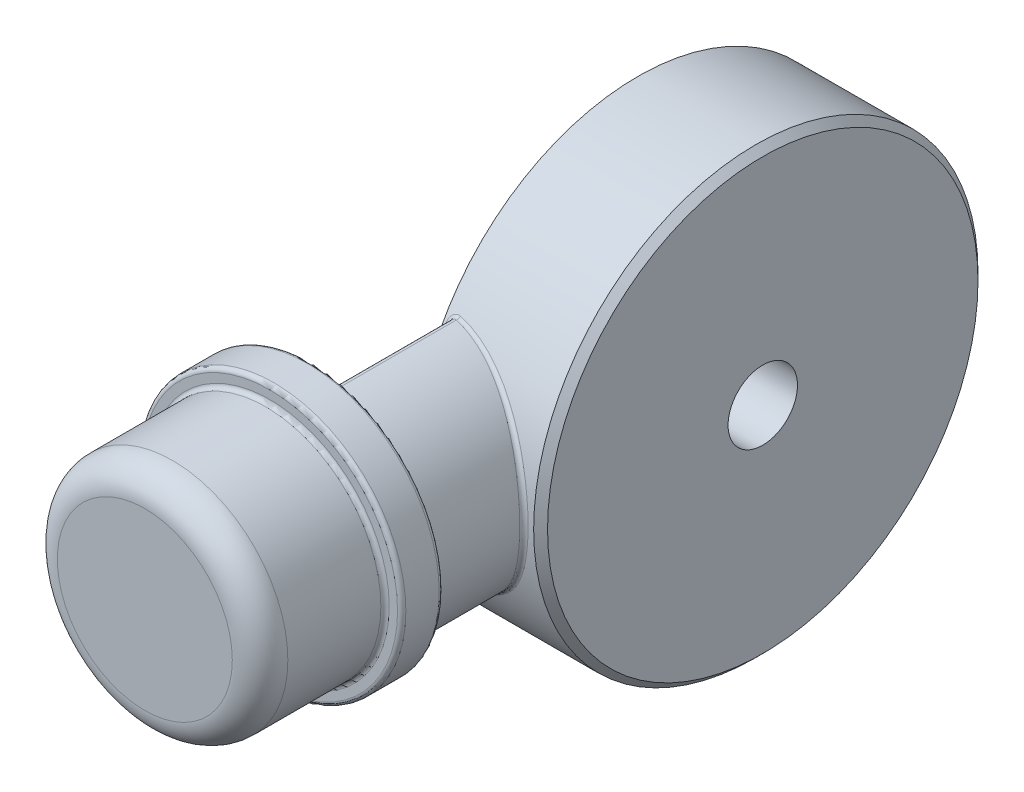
ISO-10303-21;
HEADER;
FILE_DESCRIPTION(('STEP AP214'),'2;1');
FILE_NAME('part.step','',(''),(''),'','','');
FILE_SCHEMA(('AUTOMOTIVE_DESIGN { 1 0 10303 214 1 1 1 1 }'));
ENDSEC;
DATA;
#1=APPLICATION_CONTEXT('core data for automotive mechanical design processes');
#2=APPLICATION_PROTOCOL_DEFINITION('international standard','automotive_design',2000,#1);
#3=PRODUCT_CONTEXT('',#1,'mechanical');
#4=PRODUCT('Part','Part','',(#3));
#5=PRODUCT_RELATED_PRODUCT_CATEGORY('part','',(#4));
#6=PRODUCT_DEFINITION_FORMATION('','',#4);
#7=PRODUCT_DEFINITION_CONTEXT('part definition',#1,'design');
#8=PRODUCT_DEFINITION('design','',#6,#7);
#9=PRODUCT_DEFINITION_SHAPE('','',#8);
#10=(LENGTH_UNIT() NAMED_UNIT(*) SI_UNIT(.MILLI.,.METRE.));
#11=(NAMED_UNIT(*) PLANE_ANGLE_UNIT() SI_UNIT($,.RADIAN.));
#12=(NAMED_UNIT(*) SI_UNIT($,.STERADIAN.) SOLID_ANGLE_UNIT());
#13=UNCERTAINTY_MEASURE_WITH_UNIT(LENGTH_MEASURE(1.E-05),#10,'distance_accuracy_value','');
#14=(GEOMETRIC_REPRESENTATION_CONTEXT(3) GLOBAL_UNCERTAINTY_ASSIGNED_CONTEXT((#13)) GLOBAL_UNIT_ASSIGNED_CONTEXT((#10,
#11,#12)) REPRESENTATION_CONTEXT('',''));
#15=CARTESIAN_POINT('',(0.,0.,0.));
#16=DIRECTION('',(0.,0.,1.));
#17=DIRECTION('',(1.,0.,0.));
#18=AXIS2_PLACEMENT_3D('',#15,#16,#17);
#19=CARTESIAN_POINT('',(1.,8.23953882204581,26.));
#20=DIRECTION('',(1.,0.,0.));
#21=DIRECTION('',(0.,0.,-1.));
#22=AXIS2_PLACEMENT_3D('',#19,#20,#21);
#23=PLANE('',#22);
#24=DIRECTION('',(0.,0.,1.));
#25=VECTOR('',#24,1.);
#26=CARTESIAN_POINT('',(1.,-7.89366834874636,23.));
#27=LINE('',#26,#25);
#28=CARTESIAN_POINT('',(1.,-7.89366834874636,14.261135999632));
#29=VERTEX_POINT('',#28);
#30=CARTESIAN_POINT('',(1.,-7.89366834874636,22.7));
#31=VERTEX_POINT('',#30);
#32=EDGE_CURVE('E205',#29,#31,#27,.T.);
#33=ORIENTED_EDGE('',*,*,#32,.T.);
#34=DIRECTION('',(0.,-1.,0.));
#35=VECTOR('',#34,1.);
#36=CARTESIAN_POINT('',(1.,8.23953882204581,22.7));
#37=LINE('',#36,#35);
#38=CARTESIAN_POINT('',(1.,7.89366834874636,22.7));
#39=VERTEX_POINT('',#38);
#40=EDGE_CURVE('E211',#31,#39,#37,.F.);
#41=ORIENTED_EDGE('',*,*,#40,.T.);
#42=DIRECTION('',(0.,0.,1.));
#43=VECTOR('',#42,1.);
#44=CARTESIAN_POINT('',(1.,7.89366834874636,13.7153199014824));
#45=LINE('',#44,#43);
#46=CARTESIAN_POINT('',(1.,7.89366834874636,14.261135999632));
#47=VERTEX_POINT('',#46);
#48=EDGE_CURVE('E209',#39,#47,#45,.F.);
#49=ORIENTED_EDGE('',*,*,#48,.T.);
#50=CARTESIAN_POINT('',(1.,0.,0.));
#51=DIRECTION('',(1.,0.,0.));
#52=DIRECTION('',(0.,0.,-1.));
#53=AXIS2_PLACEMENT_3D('',#50,#51,#52);
#54=CIRCLE('',#53,16.3);
#55=EDGE_CURVE('E207',#47,#29,#54,.T.);
#56=ORIENTED_EDGE('',*,*,#55,.T.);
#57=EDGE_LOOP('',(#33,#41,#49,#56));
#58=FACE_BOUND('',#57,.T.);
#59=ADVANCED_FACE('F49',(#58),#23,.F.);
#60=CARTESIAN_POINT('',(0.,0.,26.));
#61=DIRECTION('',(0.,0.,-1.));
#62=DIRECTION('',(-1.,0.,0.));
#63=AXIS2_PLACEMENT_3D('',#60,#61,#62);
#64=CYLINDRICAL_SURFACE('',#63,8.3);
#65=CARTESIAN_POINT('',(-1.73460559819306,8.26822102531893,13.6980480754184));
#66=CARTESIAN_POINT('',(-1.69443046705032,8.1252283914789,13.7843592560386));
#67=CARTESIAN_POINT('',(-1.67409610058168,8.12941586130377,13.9548864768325));
#68=CARTESIAN_POINT('',(-1.52884953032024,8.30984769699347,13.6728885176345));
#69=CARTESIAN_POINT('',(-1.49393517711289,8.16710198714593,13.7596441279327));
#70=CARTESIAN_POINT('',(-1.47551756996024,8.17034371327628,13.9292551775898));
#71=CARTESIAN_POINT('',(-1.32098218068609,8.34411747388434,13.651975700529));
#72=CARTESIAN_POINT('',(-1.29081460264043,8.20164155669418,13.7390573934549));
#73=CARTESIAN_POINT('',(-1.27490140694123,8.2040381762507,13.9079502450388));
#74=CARTESIAN_POINT('',(-0.902518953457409,8.39764919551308,13.6191307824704));
#75=CARTESIAN_POINT('',(-0.882063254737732,8.25555496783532,13.7067462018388));
#76=CARTESIAN_POINT('',(-0.871035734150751,8.25667121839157,13.8744894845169));
#77=CARTESIAN_POINT('',(-0.691922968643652,8.41691054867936,13.6071990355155));
#78=CARTESIAN_POINT('',(-0.676190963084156,8.27499383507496,13.6949832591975));
#79=CARTESIAN_POINT('',(-0.667786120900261,8.27560921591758,13.8623340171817));
#80=CARTESIAN_POINT('',(-0.270435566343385,8.44007734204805,13.592836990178));
#81=CARTESIAN_POINT('',(-0.264362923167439,8.2983429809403,13.6808429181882));
#82=CARTESIAN_POINT('',(-0.261001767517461,8.29838709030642,13.8477026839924));
#83=CARTESIAN_POINT('',(-0.0595494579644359,8.44404949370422,13.5903654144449));
#84=CARTESIAN_POINT('',(-0.0581580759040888,8.30234969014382,13.6784072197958));
#85=CARTESIAN_POINT('',(-0.0574721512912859,8.30229255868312,13.8451847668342));
#86=CARTESIAN_POINT('',(0.36182107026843,8.43677872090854,13.5948812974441));
#87=CARTESIAN_POINT('',(0.353587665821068,8.29502162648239,13.6828535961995));
#88=CARTESIAN_POINT('',(0.349199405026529,8.2951438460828,13.8497853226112));
#89=CARTESIAN_POINT('',(0.572305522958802,8.42553709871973,13.6018679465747));
#90=CARTESIAN_POINT('',(0.559384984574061,8.28367903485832,13.6897404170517));
#91=CARTESIAN_POINT('',(0.552341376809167,8.28409094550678,13.8569029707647));
#92=CARTESIAN_POINT('',(0.991476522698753,8.38797442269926,13.6250641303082));
#93=CARTESIAN_POINT('',(0.968899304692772,8.24583098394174,13.7125713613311));
#94=CARTESIAN_POINT('',(0.956890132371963,8.24715886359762,13.8805340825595));
#95=CARTESIAN_POINT('',(1.2001618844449,8.36164409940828,13.641279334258));
#96=CARTESIAN_POINT('',(1.17286313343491,8.21926962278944,13.7285490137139));
#97=CARTESIAN_POINT('',(1.15829577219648,8.22127056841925,13.8970533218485));
#98=CARTESIAN_POINT('',(1.61417957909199,8.29424822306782,13.6823597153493));
#99=CARTESIAN_POINT('',(1.57716655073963,8.15138943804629,13.7689606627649));
#100=CARTESIAN_POINT('',(1.5578709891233,8.15500612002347,13.9389039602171));
#101=CARTESIAN_POINT('',(1.81951056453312,8.25317689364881,13.7072282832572));
#102=CARTESIAN_POINT('',(1.77773332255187,8.10998409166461,13.7934451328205));
#103=CARTESIAN_POINT('',(1.7560392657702,8.11462428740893,13.9642388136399));
#104=CARTESIAN_POINT('',(2.42847663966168,8.10851022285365,13.7936551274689));
#105=CARTESIAN_POINT('',(2.37310655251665,7.96406099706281,13.878564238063));
#106=CARTESIAN_POINT('',(2.3437623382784,7.97238625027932,14.0522861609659));
#107=CARTESIAN_POINT('',(2.8253068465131,7.98344171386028,13.8670481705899));
#108=CARTESIAN_POINT('',(2.76069562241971,7.83769396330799,13.9509320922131));
#109=CARTESIAN_POINT('',(2.72674963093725,7.84941736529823,14.1270553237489));
#110=CARTESIAN_POINT('',(3.60370830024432,7.67624466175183,14.0394785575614));
#111=CARTESIAN_POINT('',(3.51871067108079,7.52899473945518,14.1199839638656));
#112=CARTESIAN_POINT('',(3.47799754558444,7.54737747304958,14.3027187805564));
#113=CARTESIAN_POINT('',(3.98441909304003,7.49245995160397,14.1392435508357));
#114=CARTESIAN_POINT('',(3.88921141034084,7.3438072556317,14.2179474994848));
#115=CARTESIAN_POINT('',(3.84542772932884,7.36667810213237,14.4043543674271));
#116=CARTESIAN_POINT('',(4.71163742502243,7.07417974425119,14.3530888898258));
#117=CARTESIAN_POINT('',(4.59474991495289,6.92476994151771,14.4267245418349));
#118=CARTESIAN_POINT('',(4.547277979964,6.95541989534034,14.6222093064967));
#119=CARTESIAN_POINT('',(5.05810304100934,6.83962318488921,14.467186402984));
#120=CARTESIAN_POINT('',(4.93019540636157,6.68944210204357,14.5380724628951));
#121=CARTESIAN_POINT('',(4.88165758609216,6.72480102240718,14.7384461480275));
#122=CARTESIAN_POINT('',(5.75922621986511,6.28695452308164,14.7166213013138));
#123=CARTESIAN_POINT('',(5.60797851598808,6.13730188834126,14.7805359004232));
#124=CARTESIAN_POINT('',(5.55832297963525,6.18141044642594,14.9925579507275));
#125=CARTESIAN_POINT('',(6.10776333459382,5.96165442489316,14.8526365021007));
#126=CARTESIAN_POINT('',(5.94286183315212,5.81265820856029,14.9121555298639));
#127=CARTESIAN_POINT('',(5.89470182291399,5.86157141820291,15.1311234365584));
#128=CARTESIAN_POINT('',(6.74572024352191,5.25725017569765,15.1162837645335));
#129=CARTESIAN_POINT('',(6.55421565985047,5.11434586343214,15.1659476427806));
#130=CARTESIAN_POINT('',(6.5104044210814,5.16899256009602,15.3997140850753));
#131=CARTESIAN_POINT('',(7.03526434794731,4.87826207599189,15.2439330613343));
#132=CARTESIAN_POINT('',(6.82944899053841,4.73953586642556,15.2879332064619));
#133=CARTESIAN_POINT('',(6.78984814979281,4.79636683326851,15.5297568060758));
#134=CARTESIAN_POINT('',(7.39634282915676,4.31157680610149,15.4090847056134));
#135=CARTESIAN_POINT('',(7.17004526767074,4.18578459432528,15.4442523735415));
#136=CARTESIAN_POINT('',(7.13833086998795,4.23919495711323,15.6980050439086));
#137=CARTESIAN_POINT('',(7.49567426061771,4.143023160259,15.4553202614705));
#138=CARTESIAN_POINT('',(7.26408211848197,4.02028916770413,15.4881633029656));
#139=CARTESIAN_POINT('',(7.23419725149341,4.07347095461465,15.7451075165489));
#140=CARTESIAN_POINT('',(7.68267621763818,3.79866210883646,15.5435447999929));
#141=CARTESIAN_POINT('',(7.44094180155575,3.68270487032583,15.5718399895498));
#142=CARTESIAN_POINT('',(7.41467588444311,3.73489096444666,15.8349862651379));
#143=CARTESIAN_POINT('',(7.77034357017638,3.62285274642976,15.5855326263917));
#144=CARTESIAN_POINT('',(7.52359822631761,3.51066977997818,15.6115379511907));
#145=CARTESIAN_POINT('',(7.49928507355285,3.56203305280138,15.8777613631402));
#146=CARTESIAN_POINT('',(8.02762366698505,3.05756575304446,15.710096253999));
#147=CARTESIAN_POINT('',(7.76714886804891,2.95579482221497,15.729729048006));
#148=CARTESIAN_POINT('',(7.74759028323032,3.0062359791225,16.0046605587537));
#149=CARTESIAN_POINT('',(8.17491231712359,2.65586821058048,15.7835287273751));
#150=CARTESIAN_POINT('',(7.90435441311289,2.56561645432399,15.7982850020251));
#151=CARTESIAN_POINT('',(7.88974095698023,2.61128205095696,16.0794698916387));
#152=CARTESIAN_POINT('',(8.40665271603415,1.83075173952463,15.900382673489));
#153=CARTESIAN_POINT('',(8.12099221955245,1.76501976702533,15.9076883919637));
#154=CARTESIAN_POINT('',(8.1133973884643,1.80001746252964,16.1985148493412));
#155=CARTESIAN_POINT('',(8.49103896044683,1.40731065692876,15.9437728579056));
#156=CARTESIAN_POINT('',(8.19888479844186,1.35691792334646,15.9477794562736));
#157=CARTESIAN_POINT('',(8.19483992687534,1.38368502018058,16.2427185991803));
#158=CARTESIAN_POINT('',(8.59301032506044,0.54979894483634,15.9963229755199));
#159=CARTESIAN_POINT('',(8.29369703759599,0.528834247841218,15.9966831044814));
#160=CARTESIAN_POINT('',(8.29325415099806,0.540569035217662,16.2962540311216));
#161=CARTESIAN_POINT('',(8.61048411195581,0.115711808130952,16.0054258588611));
#162=CARTESIAN_POINT('',(8.30975355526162,0.112103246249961,16.0050518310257));
#163=CARTESIAN_POINT('',(8.31011838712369,0.11376926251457,16.3055275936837));
#164=CARTESIAN_POINT('',(8.57740790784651,-0.749101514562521,15.9883050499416));
#165=CARTESIAN_POINT('',(8.27903684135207,-0.722164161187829,15.9891403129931));
#166=CARTESIAN_POINT('',(8.27819600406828,-0.736525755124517,16.2880857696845));
#167=CARTESIAN_POINT('',(8.5268761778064,-1.17982857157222,15.9620908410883));
#168=CARTESIAN_POINT('',(8.23253544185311,-1.13621374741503,15.9650011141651));
#169=CARTESIAN_POINT('',(8.22942700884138,-1.16002185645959,16.2613800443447));
#170=CARTESIAN_POINT('',(8.36249246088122,-2.01440757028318,15.8780876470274));
#171=CARTESIAN_POINT('',(8.07933415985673,-1.94379646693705,15.8866239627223));
#172=CARTESIAN_POINT('',(8.07077760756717,-1.98059011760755,16.1758017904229));
#173=CARTESIAN_POINT('',(8.25031703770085,-2.4186668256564,15.8211353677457));
#174=CARTESIAN_POINT('',(7.97533887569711,-2.33478685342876,15.8337454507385));
#175=CARTESIAN_POINT('',(7.96251528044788,-2.37806275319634,16.1177816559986));
#176=CARTESIAN_POINT('',(7.96839103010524,-3.2024980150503,15.6812852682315));
#177=CARTESIAN_POINT('',(7.71089788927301,-3.09759916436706,15.7023239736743));
#178=CARTESIAN_POINT('',(7.69042390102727,-3.14873514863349,15.9753093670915));
#179=CARTESIAN_POINT('',(7.79862680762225,-3.58206407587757,15.5983813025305));
#180=CARTESIAN_POINT('',(7.55196360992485,-3.46777746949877,15.6244964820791));
#181=CARTESIAN_POINT('',(7.52658168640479,-3.52192913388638,15.8908509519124));
#182=CARTESIAN_POINT('',(7.39476582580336,-4.33190080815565,15.4075812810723));
#183=CARTESIAN_POINT('',(7.17023457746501,-4.20235550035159,15.4436356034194));
#184=CARTESIAN_POINT('',(7.13680887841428,-4.25917776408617,15.6964734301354));
#185=CARTESIAN_POINT('',(7.1573095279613,-4.70010534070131,15.2984464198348));
#186=CARTESIAN_POINT('',(6.94561187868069,-4.56477464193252,15.3399519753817));
#187=CARTESIAN_POINT('',(6.90763593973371,-4.62120095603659,15.5852922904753));
#188=CARTESIAN_POINT('',(6.62995463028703,-5.39417432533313,15.0677439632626));
#189=CARTESIAN_POINT('',(6.44250403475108,-5.25025090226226,15.1189922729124));
#190=CARTESIAN_POINT('',(6.39867714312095,-5.30361805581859,15.3502641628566));
#191=CARTESIAN_POINT('',(6.34001610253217,-5.72000621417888,14.9461669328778));
#192=CARTESIAN_POINT('',(6.16538988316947,-5.57376446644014,15.0021108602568));
#193=CARTESIAN_POINT('',(6.1188527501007,-5.6239799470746,15.2264075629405));
#194=CARTESIAN_POINT('',(5.67933396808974,-6.35710606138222,14.6873379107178));
#195=CARTESIAN_POINT('',(5.53092907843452,-6.20642940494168,14.7523113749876));
#196=CARTESIAN_POINT('',(5.48121766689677,-6.25038429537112,14.9627254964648));
#197=CARTESIAN_POINT('',(5.3032281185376,-6.6629189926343,14.5498213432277));
#198=CARTESIAN_POINT('',(5.16828925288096,-6.51255357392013,14.6186780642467));
#199=CARTESIAN_POINT('',(5.11823178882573,-6.55106330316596,14.8226304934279));
#200=CARTESIAN_POINT('',(4.50034986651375,-7.20955360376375,14.2868654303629));
#201=CARTESIAN_POINT('',(4.39116761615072,-7.05906688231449,14.3626683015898));
#202=CARTESIAN_POINT('',(4.34336091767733,-7.08852112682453,14.5547441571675));
#203=CARTESIAN_POINT('',(4.07357540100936,-7.45037263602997,14.1614265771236));
#204=CARTESIAN_POINT('',(3.97653460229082,-7.30163234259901,14.2396680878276));
#205=CARTESIAN_POINT('',(3.93147393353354,-7.32529733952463,14.4269533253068));
#206=CARTESIAN_POINT('',(3.39902013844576,-7.75830212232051,13.9936668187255));
#207=CARTESIAN_POINT('',(3.31797378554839,-7.61196834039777,14.074791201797));
#208=CARTESIAN_POINT('',(3.28044966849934,-7.62805737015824,14.2560480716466));
#209=CARTESIAN_POINT('',(3.16649214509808,-7.85258070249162,13.9408179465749));
#210=CARTESIAN_POINT('',(3.09148487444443,-7.7068301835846,14.0229156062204));
#211=CARTESIAN_POINT('',(3.05603311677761,-7.72075322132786,14.2022082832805));
#212=CARTESIAN_POINT('',(2.69217411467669,-8.02124237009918,13.8444612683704));
#213=CARTESIAN_POINT('',(2.62937240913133,-7.87638447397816,13.9283812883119));
#214=CARTESIAN_POINT('',(2.59826106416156,-7.88658343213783,14.1040449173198));
#215=CARTESIAN_POINT('',(2.45038935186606,-8.09563659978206,13.8009482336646));
#216=CARTESIAN_POINT('',(2.3934857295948,-7.95134445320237,13.8855881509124));
#217=CARTESIAN_POINT('',(2.36491065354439,-7.959728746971,14.0597160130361));
#218=CARTESIAN_POINT('',(1.95962238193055,-8.22341639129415,13.725194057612));
#219=CARTESIAN_POINT('',(1.91471919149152,-8.07994169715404,13.8111539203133));
#220=CARTESIAN_POINT('',(1.89126346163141,-8.08536339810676,13.9825414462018));
#221=CARTESIAN_POINT('',(1.71064852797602,-8.27682535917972,13.6929403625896));
#222=CARTESIAN_POINT('',(1.67150214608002,-8.13381460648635,13.7793838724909));
#223=CARTESIAN_POINT('',(1.65097474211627,-8.13787574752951,13.9496829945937));
#224=CARTESIAN_POINT('',(1.20753083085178,-8.36184062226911,13.6411920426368));
#225=CARTESIAN_POINT('',(1.18022035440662,-8.2194390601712,13.7284808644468));
#226=CARTESIAN_POINT('',(1.16540766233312,-8.22146379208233,13.8969643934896));
#227=CARTESIAN_POINT('',(0.95338828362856,-8.39345231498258,13.6216942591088));
#228=CARTESIAN_POINT('',(0.931747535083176,-8.25134665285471,13.7092570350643));
#229=CARTESIAN_POINT('',(0.920130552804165,-8.25254479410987,13.8771010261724));
#230=CARTESIAN_POINT('',(0.477657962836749,-8.4314809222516,13.5981815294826));
#231=CARTESIAN_POINT('',(0.466904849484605,-8.2896709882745,13.6861099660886));
#232=CARTESIAN_POINT('',(0.460995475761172,-8.28993498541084,13.8531474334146));
#233=CARTESIAN_POINT('',(0.256392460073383,-8.44076165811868,13.5924080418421));
#234=CARTESIAN_POINT('',(0.250545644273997,-8.2990360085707,13.6804183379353));
#235=CARTESIAN_POINT('',(0.2474485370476,-8.29905991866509,13.8472656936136));
#236=CARTESIAN_POINT('',(-0.186245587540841,-8.44253351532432,13.5913066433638));
#237=CARTESIAN_POINT('',(-0.181984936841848,-8.30082242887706,13.6793335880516));
#238=CARTESIAN_POINT('',(-0.179748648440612,-8.30080203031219,13.8461436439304));
#239=CARTESIAN_POINT('',(-0.407618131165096,-8.43502482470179,13.5959786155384));
#240=CARTESIAN_POINT('',(-0.398453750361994,-8.29324647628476,13.6839388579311));
#241=CARTESIAN_POINT('',(-0.393398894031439,-8.29341939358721,13.8509032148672));
#242=CARTESIAN_POINT('',(-0.849835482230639,-8.40323150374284,13.6156572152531));
#243=CARTESIAN_POINT('',(-0.830512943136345,-8.2612052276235,13.7033118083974));
#244=CARTESIAN_POINT('',(-0.820190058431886,-8.2621598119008,13.8709507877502));
#245=CARTESIAN_POINT('',(-1.07067074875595,-8.37885516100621,13.6307203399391));
#246=CARTESIAN_POINT('',(-1.04638563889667,-8.23660347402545,13.7181616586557));
#247=CARTESIAN_POINT('',(-1.03332176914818,-8.23819269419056,13.8862963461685));
#248=CARTESIAN_POINT('',(-1.50888624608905,-8.31362714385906,13.6705806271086));
#249=CARTESIAN_POINT('',(-1.47437351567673,-8.170917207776,13.7573684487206));
#250=CARTESIAN_POINT('',(-1.45625067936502,-8.17405971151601,13.9269040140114));
#251=CARTESIAN_POINT('',(-1.72626642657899,-8.27277522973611,13.6953779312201));
#252=CARTESIAN_POINT('',(-1.68676223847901,-8.12974497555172,13.7817768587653));
#253=CARTESIAN_POINT('',(-1.66604783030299,-8.13389361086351,13.9521662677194));
#254=CARTESIAN_POINT('',(-1.94106592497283,-8.22388446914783,13.7247121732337));
#255=CARTESIAN_POINT('',(-1.89594680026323,-8.08058930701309,13.8105750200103));
#256=CARTESIAN_POINT('',(-1.87335432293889,-8.08582361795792,13.9820505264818));
#257=(BOUNDED_SURFACE() B_SPLINE_SURFACE(3,2,((#65,#66,#67),(#68,#69,#70),(#71,#72,#73),(#74,
#75,#76),(#77,#78,#79),(#80,#81,#82),(#83,#84,#85),(#86,#87,#88),(#89,#90,#91),(#92,#93,#94),
(#95,#96,#97),(#98,#99,#100),(#101,#102,#103),(#104,#105,#106),(#107,#108,#109),(#110,#111,
#112),(#113,#114,#115),(#116,#117,#118),(#119,#120,#121),(#122,#123,#124),(#125,#126,#127),
(#128,#129,#130),(#131,#132,#133),(#134,#135,#136),(#137,#138,#139),(#140,#141,#142),(#143,#144,
#145),(#146,#147,#148),(#149,#150,#151),(#152,#153,#154),(#155,#156,#157),(#158,#159,#160),
(#161,#162,#163),(#164,#165,#166),(#167,#168,#169),(#170,#171,#172),(#173,#174,#175),(#176,#177,
#178),(#179,#180,#181),(#182,#183,#184),(#185,#186,#187),(#188,#189,#190),(#191,#192,#193),
(#194,#195,#196),(#197,#198,#199),(#200,#201,#202),(#203,#204,#205),(#206,#207,#208),(#209,#210,
#211),(#212,#213,#214),(#215,#216,#217),(#218,#219,#220),(#221,#222,#223),(#224,#225,#226),
(#227,#228,#229),(#230,#231,#232),(#233,#234,#235),(#236,#237,#238),(#239,#240,#241),(#242,#243,
#244),(#245,#246,#247),(#248,#249,#250),(#251,#252,#253),(#254,#255,#256)),.UNSPECIFIED.,.F.,
.F.,.F.) B_SPLINE_SURFACE_WITH_KNOTS((4,2,2,2,2,2,2,2,2,2,2,2,2,2,2,2,2,2,2,2,2,2,2,2,2,2,2,2,2,
2,2,4),(3,3),(0.,0.634771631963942,1.26956828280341,1.90159196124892,2.53356154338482,
3.16591978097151,3.79852608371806,5.06307669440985,6.36702071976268,7.6725417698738,
9.1677003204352,10.6596749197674,11.2709217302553,11.8823344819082,13.2000333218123,
14.5191024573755,15.8403653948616,17.161273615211,18.447916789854,19.7348648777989,
21.102303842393,22.4707875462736,23.9883776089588,25.5060294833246,26.2769276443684,
27.0473929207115,27.8169963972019,28.5864092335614,29.2501584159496,29.9139001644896,
30.5812794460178,31.2486684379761),(0.,1.),
.UNSPECIFIED.) GEOMETRIC_REPRESENTATION_ITEM() RATIONAL_B_SPLINE_SURFACE(((1.,0.867796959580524,
1.),(1.,0.869266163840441,1.),(1.,0.870481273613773,1.),(1.,0.872384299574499,1.),(1.,
0.873072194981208,1.),(1.,0.873899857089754,1.),(1.,0.874042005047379,1.),(1.,0.873782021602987,
1.),(1.,0.873379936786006,1.),(1.,0.872040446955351,1.),(1.,0.871102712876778,1.),(1.,
0.868714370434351,1.),(1.,0.867263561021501,1.),(1.,0.862186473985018,1.),(1.,0.857834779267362,
1.),(1.,0.847389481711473,1.),(1.,0.841245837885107,1.),(1.,0.827731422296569,1.),(1.,
0.820359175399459,1.),(1.,0.803787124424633,1.),(1.,0.794477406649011,1.),(1.,0.775850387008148,
1.),(1.,0.766533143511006,1.),(1.,0.754141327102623,1.),(1.,0.750628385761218,1.),(1.,
0.743853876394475,1.),(1.,0.740592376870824,1.),(1.,0.730822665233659,1.),(1.,0.724916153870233,
1.),(1.,0.715402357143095,1.),(1.,0.711797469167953,1.),(1.,0.7074203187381,1.),(1.,
0.706652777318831,1.),(1.,0.708085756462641,1.),(1.,0.710285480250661,1.),(1.,0.71721940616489,
1.),(1.,0.721886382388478,1.),(1.,0.733094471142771,1.),(1.,0.7396360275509,1.),(1.,
0.754301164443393,1.),(1.,0.762498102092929,1.),(1.,0.779318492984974,1.),(1.,0.787942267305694,
1.),(1.,0.80577559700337,1.),(1.,0.814946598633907,1.),(1.,0.831991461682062,1.),(1.,
0.839865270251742,1.),(1.,0.850171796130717,1.),(1.,0.853375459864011,1.),(1.,0.859162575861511,
1.),(1.,0.861746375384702,1.),(1.,0.86621370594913,1.),(1.,0.868098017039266,1.),(1.,
0.871108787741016,1.),(1.,0.872235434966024,1.),(1.,0.873592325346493,1.),(1.,0.873924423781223,
1.),(1.,0.873987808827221,1.),(1.,0.87371910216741,1.),(1.,0.872584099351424,1.),(1.,
0.871714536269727,1.),(1.,0.869400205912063,1.),(1.,0.867955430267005,1.),(1.,0.866235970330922,1.))) REPRESENTATION_ITEM('') SURFACE());
#258=CARTESIAN_POINT('',(-1.87335432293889,-8.08582361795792,13.9820505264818));
#259=CARTESIAN_POINT('',(-1.66604783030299,-8.13389361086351,13.9521662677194));
#260=CARTESIAN_POINT('',(-1.45625067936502,-8.174059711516,13.9269040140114));
#261=CARTESIAN_POINT('',(-1.03332176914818,-8.23819269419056,13.8862963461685));
#262=CARTESIAN_POINT('',(-0.820190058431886,-8.2621598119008,13.8709507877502));
#263=CARTESIAN_POINT('',(-0.393398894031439,-8.29341939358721,13.8509032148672));
#264=CARTESIAN_POINT('',(-0.179748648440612,-8.30080203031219,13.8461436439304));
#265=CARTESIAN_POINT('',(0.247448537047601,-8.29905991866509,13.8472656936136));
#266=CARTESIAN_POINT('',(0.460995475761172,-8.28993498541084,13.8531474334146));
#267=CARTESIAN_POINT('',(0.920130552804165,-8.25254479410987,13.8771010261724));
#268=CARTESIAN_POINT('',(1.16540766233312,-8.22146379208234,13.8969643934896));
#269=CARTESIAN_POINT('',(1.65097474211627,-8.13787574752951,13.9496829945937));
#270=CARTESIAN_POINT('',(1.89126346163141,-8.08536339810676,13.9825414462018));
#271=CARTESIAN_POINT('',(2.36491065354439,-7.95972874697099,14.0597160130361));
#272=CARTESIAN_POINT('',(2.59826106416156,-7.88658343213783,14.1040449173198));
#273=CARTESIAN_POINT('',(3.05603311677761,-7.72075322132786,14.2022082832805));
#274=CARTESIAN_POINT('',(3.28044966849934,-7.62805737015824,14.2560480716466));
#275=CARTESIAN_POINT('',(3.93147393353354,-7.32529733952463,14.4269533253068));
#276=CARTESIAN_POINT('',(4.34336091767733,-7.08852112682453,14.5547441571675));
#277=CARTESIAN_POINT('',(5.11823178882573,-6.55106330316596,14.8226304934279));
#278=CARTESIAN_POINT('',(5.48121766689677,-6.25038429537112,14.9627254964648));
#279=CARTESIAN_POINT('',(6.1188527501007,-5.6239799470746,15.2264075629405));
#280=CARTESIAN_POINT('',(6.39867714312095,-5.30361805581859,15.3502641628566));
#281=CARTESIAN_POINT('',(6.90763593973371,-4.62120095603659,15.5852922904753));
#282=CARTESIAN_POINT('',(7.13680887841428,-4.25917776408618,15.6964734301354));
#283=CARTESIAN_POINT('',(7.52658168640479,-3.52192913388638,15.8908509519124));
#284=CARTESIAN_POINT('',(7.69042390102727,-3.14873514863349,15.9753093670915));
#285=CARTESIAN_POINT('',(7.96251528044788,-2.37806275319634,16.1177816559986));
#286=CARTESIAN_POINT('',(8.07077760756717,-1.98059011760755,16.1758017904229));
#287=CARTESIAN_POINT('',(8.22942700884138,-1.16002185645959,16.2613800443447));
#288=CARTESIAN_POINT('',(8.27819600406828,-0.736525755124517,16.2880857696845));
#289=CARTESIAN_POINT('',(8.31011838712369,0.11376926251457,16.3055275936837));
#290=CARTESIAN_POINT('',(8.29325415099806,0.540569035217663,16.2962540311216));
#291=CARTESIAN_POINT('',(8.19483992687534,1.38368502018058,16.2427185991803));
#292=CARTESIAN_POINT('',(8.1133973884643,1.80001746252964,16.1985148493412));
#293=CARTESIAN_POINT('',(7.88974095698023,2.61128205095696,16.0794698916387));
#294=CARTESIAN_POINT('',(7.74759028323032,3.0062359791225,16.0046605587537));
#295=CARTESIAN_POINT('',(7.49928507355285,3.56203305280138,15.8777613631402));
#296=CARTESIAN_POINT('',(7.41467588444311,3.73489096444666,15.8349862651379));
#297=CARTESIAN_POINT('',(7.23419725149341,4.07347095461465,15.7451075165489));
#298=CARTESIAN_POINT('',(7.13833086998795,4.23919495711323,15.6980050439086));
#299=CARTESIAN_POINT('',(6.78984814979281,4.79636683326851,15.5297568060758));
#300=CARTESIAN_POINT('',(6.5104044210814,5.16899256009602,15.3997140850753));
#301=CARTESIAN_POINT('',(5.89470182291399,5.86157141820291,15.1311234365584));
#302=CARTESIAN_POINT('',(5.55832297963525,6.18141044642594,14.9925579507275));
#303=CARTESIAN_POINT('',(4.88165758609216,6.72480102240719,14.7384461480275));
#304=CARTESIAN_POINT('',(4.547277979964,6.95541989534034,14.6222093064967));
#305=CARTESIAN_POINT('',(3.84542772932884,7.36667810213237,14.4043543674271));
#306=CARTESIAN_POINT('',(3.47799754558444,7.54737747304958,14.3027187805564));
#307=CARTESIAN_POINT('',(2.72674963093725,7.84941736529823,14.1270553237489));
#308=CARTESIAN_POINT('',(2.3437623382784,7.97238625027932,14.0522861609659));
#309=CARTESIAN_POINT('',(1.7560392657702,8.11462428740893,13.9642388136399));
#310=CARTESIAN_POINT('',(1.5578709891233,8.15500612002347,13.9389039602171));
#311=CARTESIAN_POINT('',(1.15829577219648,8.22127056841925,13.8970533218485));
#312=CARTESIAN_POINT('',(0.956890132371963,8.24715886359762,13.8805340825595));
#313=CARTESIAN_POINT('',(0.552341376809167,8.28409094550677,13.8569029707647));
#314=CARTESIAN_POINT('',(0.349199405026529,8.2951438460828,13.8497853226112));
#315=CARTESIAN_POINT('',(-0.0574721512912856,8.30229255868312,13.8451847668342));
#316=CARTESIAN_POINT('',(-0.261001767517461,8.29838709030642,13.8477026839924));
#317=CARTESIAN_POINT('',(-0.667786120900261,8.27560921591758,13.8623340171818));
#318=CARTESIAN_POINT('',(-0.871035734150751,8.25667121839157,13.8744894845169));
#319=CARTESIAN_POINT('',(-1.27490140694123,8.2040381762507,13.9079502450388));
#320=CARTESIAN_POINT('',(-1.47551756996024,8.17034371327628,13.9292551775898));
#321=CARTESIAN_POINT('',(-1.67409610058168,8.12941586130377,13.9548864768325));
#322=B_SPLINE_CURVE_WITH_KNOTS('',3,(#258,#259,#260,#261,#262,#263,#264,#265,#266,#267,#268,
#269,#270,#271,#272,#273,#274,#275,#276,#277,#278,#279,#280,#281,#282,#283,#284,#285,#286,#287,
#288,#289,#290,#291,#292,#293,#294,#295,#296,#297,#298,#299,#300,#301,#302,#303,#304,#305,#306,
#307,#308,#309,#310,#311,#312,#313,#314,#315,#316,#317,#318,#319,#320,#321),.UNSPECIFIED.,.F.,
.F.,(4,2,2,2,2,2,2,2,2,2,2,2,2,2,2,2,2,2,2,2,2,2,2,2,2,2,2,2,2,2,2,4),(0.,0.66738899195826,
1.3347682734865,1.99851002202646,2.66225920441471,3.43167204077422,4.20127551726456,
4.9717407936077,5.74263895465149,7.26029082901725,8.77788089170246,10.1463645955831,
11.5138035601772,12.8007516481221,14.0873948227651,15.4083030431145,16.7295659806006,
18.0486351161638,19.3663339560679,19.9777467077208,20.5889935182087,22.0809681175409,
23.5761266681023,24.8816477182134,26.1855917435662,27.450142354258,28.0827486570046,
28.7151068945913,29.3470764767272,29.9791001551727,30.6138968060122,31.2486684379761),.UNSPECIFIED.);
#323=CARTESIAN_POINT('',(1.34875,-8.18968091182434,13.9170042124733));
#324=VERTEX_POINT('',#323);
#325=CARTESIAN_POINT('',(1.34875,8.18968091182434,13.9170042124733));
#326=VERTEX_POINT('',#325);
#327=EDGE_CURVE('E216',#324,#326,#322,.T.);
#328=ORIENTED_EDGE('',*,*,#327,.T.);
#329=DIRECTION('',(0.,0.,-1.));
#330=VECTOR('',#329,1.);
#331=CARTESIAN_POINT('',(1.34875,8.18968091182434,26.));
#332=LINE('',#331,#330);
#333=CARTESIAN_POINT('',(1.34875,8.18968091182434,22.7));
#334=VERTEX_POINT('',#333);
#335=EDGE_CURVE('E548',#326,#334,#332,.F.);
#336=ORIENTED_EDGE('',*,*,#335,.T.);
#337=CARTESIAN_POINT('',(0.,0.,22.7));
#338=DIRECTION('',(0.,0.,1.));
#339=DIRECTION('',(1.,0.,0.));
#340=AXIS2_PLACEMENT_3D('',#337,#338,#339);
#341=CIRCLE('',#340,8.3);
#342=CARTESIAN_POINT('',(1.34875,-8.18968091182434,22.7));
#343=VERTEX_POINT('',#342);
#344=EDGE_CURVE('E224',#334,#343,#341,.F.);
#345=ORIENTED_EDGE('',*,*,#344,.T.);
#346=DIRECTION('',(0.,0.,-1.));
#347=VECTOR('',#346,1.);
#348=CARTESIAN_POINT('',(1.34875,-8.18968091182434,26.));
#349=LINE('',#348,#347);
#350=EDGE_CURVE('E214',#343,#324,#349,.T.);
#351=ORIENTED_EDGE('',*,*,#350,.T.);
#352=EDGE_LOOP('',(#328,#336,#345,#351));
#353=FACE_BOUND('',#352,.T.);
#354=ADVANCED_FACE('F230',(#353),#64,.T.);
#355=CARTESIAN_POINT('',(9.5,0.,0.));
#356=DIRECTION('',(-1.,0.,0.));
#357=DIRECTION('',(0.,0.,1.));
#358=AXIS2_PLACEMENT_3D('',#355,#356,#357);
#359=CYLINDRICAL_SURFACE('',#358,16.);
#360=CARTESIAN_POINT('',(9.,0.,0.));
#361=DIRECTION('',(1.,0.,0.));
#362=DIRECTION('',(0.,0.,-1.));
#363=AXIS2_PLACEMENT_3D('',#360,#361,#362);
#364=CIRCLE('',#363,16.);
#365=CARTESIAN_POINT('',(9.,0.,-16.));
#366=VERTEX_POINT('',#365);
#367=EDGE_CURVE('E401',#366,#366,#364,.F.);
#368=ORIENTED_EDGE('',*,*,#367,.T.);
#369=EDGE_LOOP('',(#368));
#370=FACE_BOUND('',#369,.T.);
#371=CARTESIAN_POINT('',(0.741610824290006,7.53287841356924,14.1157976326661));
#372=CARTESIAN_POINT('',(1.07891403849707,7.63610338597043,14.0607117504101));
#373=CARTESIAN_POINT('',(1.020805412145,7.78389411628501,14.3804688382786));
#374=CARTESIAN_POINT('',(0.727705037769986,7.56759630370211,14.0972771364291));
#375=CARTESIAN_POINT('',(1.06266589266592,7.6502298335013,14.0528529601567));
#376=CARTESIAN_POINT('',(1.01385251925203,7.80157854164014,14.3616010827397));
#377=CARTESIAN_POINT('',(0.717306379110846,7.60323458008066,14.0780878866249));
#378=CARTESIAN_POINT('',(1.04735115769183,7.66714479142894,14.0435166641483));
#379=CARTESIAN_POINT('',(1.0086531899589,7.81973178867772,14.3420520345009));
#380=CARTESIAN_POINT('',(0.703450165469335,7.67540062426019,14.0388697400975));
#381=CARTESIAN_POINT('',(1.02064069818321,7.70499602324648,14.0226353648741));
#382=CARTESIAN_POINT('',(1.00172508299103,7.85649136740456,14.3020985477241));
#383=CARTESIAN_POINT('',(0.700000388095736,7.7119293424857,14.0188399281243));
#384=CARTESIAN_POINT('',(1.00913010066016,7.72581160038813,14.0111566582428));
#385=CARTESIAN_POINT('',(1.00000019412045,7.87509818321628,14.2816931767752));
#386=CARTESIAN_POINT('',(0.699999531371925,7.79240788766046,13.9742950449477));
#387=CARTESIAN_POINT('',(0.989333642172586,7.77475907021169,13.984063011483));
#388=CARTESIAN_POINT('',(0.999999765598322,7.91609194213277,14.2363130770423));
#389=CARTESIAN_POINT('',(0.705028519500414,7.83632475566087,13.94971171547));
#390=CARTESIAN_POINT('',(0.981895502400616,7.80358555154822,13.9680478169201));
#391=CARTESIAN_POINT('',(1.00251425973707,7.93846209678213,14.2112688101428));
#392=CARTESIAN_POINT('',(0.725009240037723,7.92234829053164,13.9010373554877));
#393=CARTESIAN_POINT('',(0.975497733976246,7.86302804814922,13.9347847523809));
#394=CARTESIAN_POINT('',(1.01250462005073,7.98228033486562,14.1616818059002));
#395=CARTESIAN_POINT('',(0.739979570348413,7.96445140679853,13.8769473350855));
#396=CARTESIAN_POINT('',(0.976275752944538,7.89365187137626,13.9175394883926));
#397=CARTESIAN_POINT('',(1.01998978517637,8.00372660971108,14.1371400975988));
#398=CARTESIAN_POINT('',(0.776736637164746,8.03909405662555,13.833819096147));
#399=CARTESIAN_POINT('',(0.986040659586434,7.94983072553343,13.885658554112));
#400=CARTESIAN_POINT('',(1.03836831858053,8.0417477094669,14.0932032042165));
#401=CARTESIAN_POINT('',(0.797205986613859,8.07213164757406,13.8145573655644));
#402=CARTESIAN_POINT('',(0.993631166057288,7.97544602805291,13.8710299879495));
#403=CARTESIAN_POINT('',(1.04860299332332,8.05857623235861,14.0735803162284));
#404=CARTESIAN_POINT('',(0.845010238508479,8.13428036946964,13.7780541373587));
#405=CARTESIAN_POINT('',(1.01528872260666,8.02451480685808,13.8428331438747));
#406=CARTESIAN_POINT('',(1.07250511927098,8.0902332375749,14.0363926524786));
#407=CARTESIAN_POINT('',(0.872331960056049,8.16339887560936,13.7608088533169));
#408=CARTESIAN_POINT('',(1.02923779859,8.04808428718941,13.8292023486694));
#409=CARTESIAN_POINT('',(1.08616598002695,8.10506547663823,14.0188240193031));
#410=CARTESIAN_POINT('',(0.926082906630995,8.20999568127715,13.7330450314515));
#411=CARTESIAN_POINT('',(1.05919848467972,8.08628490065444,13.8069935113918));
#412=CARTESIAN_POINT('',(1.11304145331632,8.12880072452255,13.9905396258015));
#413=CARTESIAN_POINT('',(0.951175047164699,8.22859461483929,13.7219026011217));
#414=CARTESIAN_POINT('',(1.07385758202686,8.10172202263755,13.7979783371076));
#415=CARTESIAN_POINT('',(1.12558752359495,8.13827455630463,13.9791882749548));
#416=CARTESIAN_POINT('',(1.00463606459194,8.26197692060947,13.7018289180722));
#417=CARTESIAN_POINT('',(1.10626891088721,8.12957750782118,13.7816575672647));
#418=CARTESIAN_POINT('',(1.1523180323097,8.15527866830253,13.9587382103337));
#419=CARTESIAN_POINT('',(1.03299727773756,8.27676896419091,13.6928926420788));
#420=CARTESIAN_POINT('',(1.12402007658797,8.14206837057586,13.7743102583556));
#421=CARTESIAN_POINT('',(1.16649863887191,8.16281336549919,13.9496343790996));
#422=CARTESIAN_POINT('',(1.09261699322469,8.30196785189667,13.6776295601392));
#423=CARTESIAN_POINT('',(1.16215408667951,8.1633931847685,13.7617375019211));
#424=CARTESIAN_POINT('',(1.19630849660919,8.17564904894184,13.9340851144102));
#425=CARTESIAN_POINT('',(1.12389409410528,8.31234381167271,13.6713211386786));
#426=CARTESIAN_POINT('',(1.18259012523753,8.17226272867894,13.7564911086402));
#427=CARTESIAN_POINT('',(1.2119470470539,8.1809343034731,13.9276584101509));
#428=CARTESIAN_POINT('',(1.18821191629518,8.32794121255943,13.6618256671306));
#429=CARTESIAN_POINT('',(1.22506918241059,8.18558440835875,13.7486019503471));
#430=CARTESIAN_POINT('',(1.24410595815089,8.18887922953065,13.9179848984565));
#431=CARTESIAN_POINT('',(1.2212507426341,8.33316807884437,13.6586353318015));
#432=CARTESIAN_POINT('',(1.24717076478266,8.19008402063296,13.7459311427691));
#433=CARTESIAN_POINT('',(1.26062537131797,8.19154166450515,13.9147347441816));
#434=CARTESIAN_POINT('',(1.28440783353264,8.33787730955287,13.6557609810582));
#435=CARTESIAN_POINT('',(1.28950310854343,8.19412519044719,13.7435324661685));
#436=CARTESIAN_POINT('',(1.2922039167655,8.19394042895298,13.9118064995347));
#437=CARTESIAN_POINT('',(1.31446966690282,8.33790387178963,13.655744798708));
#438=CARTESIAN_POINT('',(1.30974172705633,8.19414769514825,13.7435191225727));
#439=CARTESIAN_POINT('',(1.30723483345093,8.19395395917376,13.911790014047));
#440=CARTESIAN_POINT('',(1.37416737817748,8.33356475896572,13.6583931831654));
#441=CARTESIAN_POINT('',(1.34975700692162,8.19042512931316,13.7457286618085));
#442=CARTESIAN_POINT('',(1.33708368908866,8.1917437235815,13.9144880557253));
#443=CARTESIAN_POINT('',(1.40380285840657,8.32919522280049,13.6610601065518));
#444=CARTESIAN_POINT('',(1.36958751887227,8.18666652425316,13.7479595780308));
#445=CARTESIAN_POINT('',(1.35190142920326,8.18951799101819,13.9172049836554));
#446=CARTESIAN_POINT('',(1.46076933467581,8.31650568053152,13.668788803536));
#447=CARTESIAN_POINT('',(1.40730064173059,8.17581947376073,13.7543857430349));
#448=CARTESIAN_POINT('',(1.38038466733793,8.18305425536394,13.9250785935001));
#449=CARTESIAN_POINT('',(1.48814419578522,8.30832192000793,13.6737679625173));
#450=CARTESIAN_POINT('',(1.4252700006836,8.16881889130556,13.7585291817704));
#451=CARTESIAN_POINT('',(1.39407209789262,8.17888565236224,13.9301511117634));
#452=CARTESIAN_POINT('',(1.5409981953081,8.28846623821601,13.6858121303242));
#453=CARTESIAN_POINT('',(1.45942398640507,8.1519735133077,13.7684737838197));
#454=CARTESIAN_POINT('',(1.42049909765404,8.16877166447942,13.9424211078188));
#455=CARTESIAN_POINT('',(1.5664801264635,8.27679958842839,13.6928739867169));
#456=CARTESIAN_POINT('',(1.47563862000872,8.1420960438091,13.7742941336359));
#457=CARTESIAN_POINT('',(1.43324006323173,8.16282896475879,13.9496153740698));
#458=CARTESIAN_POINT('',(1.59073693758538,8.26358051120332,13.7008480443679));
#459=CARTESIAN_POINT('',(1.49060637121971,8.13103648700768,13.780791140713));
#460=CARTESIAN_POINT('',(1.44536846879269,8.15609549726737,13.9577389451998));
#461=(BOUNDED_SURFACE() B_SPLINE_SURFACE(3,2,((#371,#372,#373),(#374,#375,#376),(#377,#378,
#379),(#380,#381,#382),(#383,#384,#385),(#386,#387,#388),(#389,#390,#391),(#392,#393,#394),
(#395,#396,#397),(#398,#399,#400),(#401,#402,#403),(#404,#405,#406),(#407,#408,#409),(#410,#411,
#412),(#413,#414,#415),(#416,#417,#418),(#419,#420,#421),(#422,#423,#424),(#425,#426,#427),
(#428,#429,#430),(#431,#432,#433),(#434,#435,#436),(#437,#438,#439),(#440,#441,#442),(#443,#444,
#445),(#446,#447,#448),(#449,#450,#451),(#452,#453,#454),(#455,#456,#457),(#458,#459,#460)),
.UNSPECIFIED.,.F.,.F.,.F.) B_SPLINE_SURFACE_WITH_KNOTS((4,2,2,2,2,2,2,2,2,2,2,2,2,2,4),(3,3),
(0.,0.127033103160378,0.254208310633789,0.407773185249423,0.561626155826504,0.692974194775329,
0.824071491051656,0.923947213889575,1.02359338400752,1.1239254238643,1.22415163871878,
1.31388318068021,1.40369360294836,1.49051652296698,1.57720869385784),(0.,1.),
.UNSPECIFIED.) GEOMETRIC_REPRESENTATION_ITEM() RATIONAL_B_SPLINE_SURFACE(((1.,0.643321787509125,
1.),(1.,0.653801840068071,1.),(1.,0.664445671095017,1.),(1.,0.685798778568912,1.),(1.,
0.696508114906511,1.),(1.,0.719904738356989,1.),(1.,0.732541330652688,1.),(1.,0.757085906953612,
1.),(1.,0.76899247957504,1.),(1.,0.789957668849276,1.),(1.,0.79917811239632,1.),(1.,
0.816441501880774,1.),(1.,0.824486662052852,1.),(1.,0.837314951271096,1.),(1.,0.842418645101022,
1.),(1.,0.851559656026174,1.),(1.,0.855599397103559,1.),(1.,0.862471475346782,1.),(1.,
0.865295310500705,1.),(1.,0.869537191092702,1.),(1.,0.870956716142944,1.),(1.,0.872235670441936,
1.),(1.,0.872242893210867,1.),(1.,0.871064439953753,1.),(1.,0.869877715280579,1.),(1.,
0.866427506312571,1.),(1.,0.864201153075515,1.),(1.,0.85879051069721,1.),(1.,0.855607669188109,
1.),(1.,0.851994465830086,1.))) REPRESENTATION_ITEM('') SURFACE());
#462=CARTESIAN_POINT('',(1.59073693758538,8.26358051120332,13.7008480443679));
#463=CARTESIAN_POINT('',(1.5664801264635,8.27679958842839,13.6928739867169));
#464=CARTESIAN_POINT('',(1.5409981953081,8.28846623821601,13.6858121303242));
#465=CARTESIAN_POINT('',(1.48814419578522,8.30832192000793,13.6737679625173));
#466=CARTESIAN_POINT('',(1.46076933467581,8.31650568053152,13.668788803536));
#467=CARTESIAN_POINT('',(1.40380285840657,8.32919522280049,13.6610601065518));
#468=CARTESIAN_POINT('',(1.37416737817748,8.33356475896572,13.6583931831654));
#469=CARTESIAN_POINT('',(1.31446966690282,8.33790387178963,13.655744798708));
#470=CARTESIAN_POINT('',(1.28440783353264,8.33787730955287,13.6557609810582));
#471=CARTESIAN_POINT('',(1.2212507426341,8.33316807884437,13.6586353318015));
#472=CARTESIAN_POINT('',(1.18821191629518,8.32794121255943,13.6618256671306));
#473=CARTESIAN_POINT('',(1.12389409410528,8.31234381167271,13.6713211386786));
#474=CARTESIAN_POINT('',(1.09261699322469,8.30196785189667,13.6776295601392));
#475=CARTESIAN_POINT('',(1.03299727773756,8.27676896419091,13.6928926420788));
#476=CARTESIAN_POINT('',(1.00463606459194,8.26197692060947,13.7018289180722));
#477=CARTESIAN_POINT('',(0.951175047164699,8.22859461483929,13.7219026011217));
#478=CARTESIAN_POINT('',(0.926082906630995,8.20999568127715,13.7330450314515));
#479=CARTESIAN_POINT('',(0.872331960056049,8.16339887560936,13.7608088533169));
#480=CARTESIAN_POINT('',(0.845010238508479,8.13428036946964,13.7780541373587));
#481=CARTESIAN_POINT('',(0.79720598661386,8.07213164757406,13.8145573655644));
#482=CARTESIAN_POINT('',(0.776736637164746,8.03909405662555,13.833819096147));
#483=CARTESIAN_POINT('',(0.739979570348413,7.96445140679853,13.8769473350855));
#484=CARTESIAN_POINT('',(0.725009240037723,7.92234829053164,13.9010373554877));
#485=CARTESIAN_POINT('',(0.705028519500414,7.83632475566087,13.94971171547));
#486=CARTESIAN_POINT('',(0.699999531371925,7.79240788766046,13.9742950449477));
#487=CARTESIAN_POINT('',(0.700000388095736,7.7119293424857,14.0188399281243));
#488=CARTESIAN_POINT('',(0.703450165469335,7.67540062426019,14.0388697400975));
#489=CARTESIAN_POINT('',(0.717306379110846,7.60323458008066,14.0780878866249));
#490=CARTESIAN_POINT('',(0.727705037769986,7.56759630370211,14.0972771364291));
#491=CARTESIAN_POINT('',(0.741610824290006,7.53287841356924,14.1157976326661));
#492=B_SPLINE_CURVE_WITH_KNOTS('',3,(#462,#463,#464,#465,#466,#467,#468,#469,#470,#471,#472,
#473,#474,#475,#476,#477,#478,#479,#480,#481,#482,#483,#484,#485,#486,#487,#488,#489,#490,#491),
.UNSPECIFIED.,.F.,.F.,(4,2,2,2,2,2,2,2,2,2,2,2,2,2,4),(0.,0.0866921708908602,0.173515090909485,
0.263325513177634,0.353057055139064,0.453283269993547,0.553615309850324,0.653261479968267,
0.753137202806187,0.884234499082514,1.01558253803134,1.16943550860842,1.32300038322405,
1.45017559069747,1.57720869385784),.UNSPECIFIED.);
#493=CARTESIAN_POINT('',(1.3975,8.32951506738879,13.6608630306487));
#494=VERTEX_POINT('',#493);
#495=CARTESIAN_POINT('',(0.700000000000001,7.74838610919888,13.9986611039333));
#496=VERTEX_POINT('',#495);
#497=EDGE_CURVE('E547',#494,#496,#492,.T.);
#498=ORIENTED_EDGE('',*,*,#497,.F.);
#499=CARTESIAN_POINT('',(-1.73460559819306,8.26822102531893,13.6980480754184));
#500=CARTESIAN_POINT('',(-1.52884953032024,8.30984769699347,13.6728885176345));
#501=CARTESIAN_POINT('',(-1.32098218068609,8.34411747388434,13.651975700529));
#502=CARTESIAN_POINT('',(-0.902518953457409,8.39764919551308,13.6191307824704));
#503=CARTESIAN_POINT('',(-0.691922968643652,8.41691054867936,13.6071990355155));
#504=CARTESIAN_POINT('',(-0.270435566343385,8.44007734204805,13.592836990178));
#505=CARTESIAN_POINT('',(-0.0595494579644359,8.44404949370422,13.5903654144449));
#506=CARTESIAN_POINT('',(0.36182107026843,8.43677872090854,13.5948812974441));
#507=CARTESIAN_POINT('',(0.572305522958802,8.42553709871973,13.6018679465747));
#508=CARTESIAN_POINT('',(0.991476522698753,8.38797442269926,13.6250641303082));
#509=CARTESIAN_POINT('',(1.2001618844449,8.36164409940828,13.641279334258));
#510=CARTESIAN_POINT('',(1.61417957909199,8.29424822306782,13.6823597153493));
#511=CARTESIAN_POINT('',(1.81951056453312,8.25317689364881,13.7072282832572));
#512=CARTESIAN_POINT('',(2.42847663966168,8.10851022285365,13.7936551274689));
#513=CARTESIAN_POINT('',(2.8253068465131,7.98344171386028,13.8670481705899));
#514=CARTESIAN_POINT('',(3.60370830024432,7.67624466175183,14.0394785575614));
#515=CARTESIAN_POINT('',(3.98441909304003,7.49245995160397,14.1392435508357));
#516=CARTESIAN_POINT('',(4.71163742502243,7.07417974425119,14.3530888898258));
#517=CARTESIAN_POINT('',(5.05810304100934,6.83962318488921,14.467186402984));
#518=CARTESIAN_POINT('',(5.75922621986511,6.28695452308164,14.7166213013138));
#519=CARTESIAN_POINT('',(6.10776333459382,5.96165442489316,14.8526365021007));
#520=CARTESIAN_POINT('',(6.74572024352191,5.25725017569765,15.1162837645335));
#521=CARTESIAN_POINT('',(7.03526434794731,4.87826207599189,15.2439330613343));
#522=CARTESIAN_POINT('',(7.39634282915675,4.31157680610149,15.4090847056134));
#523=CARTESIAN_POINT('',(7.49567426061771,4.143023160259,15.4553202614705));
#524=CARTESIAN_POINT('',(7.68267621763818,3.79866210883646,15.5435447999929));
#525=CARTESIAN_POINT('',(7.77034357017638,3.62285274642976,15.5855326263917));
#526=CARTESIAN_POINT('',(8.02762366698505,3.05756575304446,15.710096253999));
#527=CARTESIAN_POINT('',(8.17491231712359,2.65586821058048,15.7835287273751));
#528=CARTESIAN_POINT('',(8.40665271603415,1.83075173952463,15.900382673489));
#529=CARTESIAN_POINT('',(8.49103896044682,1.40731065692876,15.9437728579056));
#530=CARTESIAN_POINT('',(8.59301032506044,0.549798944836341,15.9963229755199));
#531=CARTESIAN_POINT('',(8.61048411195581,0.115711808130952,16.0054258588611));
#532=CARTESIAN_POINT('',(8.57740790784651,-0.74910151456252,15.9883050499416));
#533=CARTESIAN_POINT('',(8.5268761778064,-1.17982857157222,15.9620908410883));
#534=CARTESIAN_POINT('',(8.36249246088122,-2.01440757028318,15.8780876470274));
#535=CARTESIAN_POINT('',(8.25031703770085,-2.4186668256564,15.8211353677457));
#536=CARTESIAN_POINT('',(7.96839103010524,-3.2024980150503,15.6812852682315));
#537=CARTESIAN_POINT('',(7.79862680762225,-3.58206407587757,15.5983813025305));
#538=CARTESIAN_POINT('',(7.39476582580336,-4.33190080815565,15.4075812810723));
#539=CARTESIAN_POINT('',(7.1573095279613,-4.70010534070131,15.2984464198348));
#540=CARTESIAN_POINT('',(6.62995463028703,-5.39417432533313,15.0677439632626));
#541=CARTESIAN_POINT('',(6.34001610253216,-5.72000621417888,14.9461669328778));
#542=CARTESIAN_POINT('',(5.67933396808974,-6.35710606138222,14.6873379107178));
#543=CARTESIAN_POINT('',(5.3032281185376,-6.6629189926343,14.5498213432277));
#544=CARTESIAN_POINT('',(4.50034986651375,-7.20955360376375,14.2868654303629));
#545=CARTESIAN_POINT('',(4.07357540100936,-7.45037263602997,14.1614265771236));
#546=CARTESIAN_POINT('',(3.39902013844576,-7.75830212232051,13.9936668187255));
#547=CARTESIAN_POINT('',(3.16649214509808,-7.85258070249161,13.9408179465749));
#548=CARTESIAN_POINT('',(2.69217411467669,-8.02124237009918,13.8444612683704));
#549=CARTESIAN_POINT('',(2.45038935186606,-8.09563659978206,13.8009482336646));
#550=CARTESIAN_POINT('',(1.95962238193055,-8.22341639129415,13.725194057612));
#551=CARTESIAN_POINT('',(1.71064852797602,-8.27682535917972,13.6929403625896));
#552=CARTESIAN_POINT('',(1.20753083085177,-8.3618406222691,13.6411920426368));
#553=CARTESIAN_POINT('',(0.95338828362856,-8.39345231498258,13.6216942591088));
#554=CARTESIAN_POINT('',(0.477657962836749,-8.4314809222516,13.5981815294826));
#555=CARTESIAN_POINT('',(0.256392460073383,-8.44076165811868,13.5924080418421));
#556=CARTESIAN_POINT('',(-0.186245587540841,-8.44253351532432,13.5913066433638));
#557=CARTESIAN_POINT('',(-0.407618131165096,-8.43502482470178,13.5959786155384));
#558=CARTESIAN_POINT('',(-0.849835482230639,-8.40323150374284,13.6156572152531));
#559=CARTESIAN_POINT('',(-1.07067074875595,-8.37885516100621,13.6307203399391));
#560=CARTESIAN_POINT('',(-1.50888624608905,-8.31362714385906,13.6705806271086));
#561=CARTESIAN_POINT('',(-1.72626642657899,-8.27277522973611,13.6953779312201));
#562=CARTESIAN_POINT('',(-1.94106592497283,-8.22388446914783,13.7247121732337));
#563=B_SPLINE_CURVE_WITH_KNOTS('',3,(#499,#500,#501,#502,#503,#504,#505,#506,#507,#508,#509,
#510,#511,#512,#513,#514,#515,#516,#517,#518,#519,#520,#521,#522,#523,#524,#525,#526,#527,#528,
#529,#530,#531,#532,#533,#534,#535,#536,#537,#538,#539,#540,#541,#542,#543,#544,#545,#546,#547,
#548,#549,#550,#551,#552,#553,#554,#555,#556,#557,#558,#559,#560,#561,#562),.UNSPECIFIED.,.F.,
.F.,(4,2,2,2,2,2,2,2,2,2,2,2,2,2,2,2,2,2,2,2,2,2,2,2,2,2,2,2,2,2,2,4),(0.,0.634771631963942,
1.26956828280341,1.90159196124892,2.53356154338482,3.16591978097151,3.79852608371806,
5.06307669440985,6.36702071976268,7.6725417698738,9.1677003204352,10.6596749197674,
11.2709217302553,11.8823344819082,13.2000333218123,14.5191024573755,15.8403653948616,
17.161273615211,18.447916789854,19.7348648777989,21.102303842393,22.4707875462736,
23.9883776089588,25.5060294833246,26.2769276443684,27.0473929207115,27.8169963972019,
28.5864092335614,29.2501584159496,29.9139001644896,30.5812794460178,31.2486684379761),.UNSPECIFIED.);
#564=CARTESIAN_POINT('',(1.3975,-8.32951506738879,13.6608630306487));
#565=VERTEX_POINT('',#564);
#566=EDGE_CURVE('E377',#494,#565,#563,.T.);
#567=ORIENTED_EDGE('',*,*,#566,.T.);
#568=CARTESIAN_POINT('',(1.56658111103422,-8.27601927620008,13.6933379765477));
#569=CARTESIAN_POINT('',(1.47549791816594,-8.1414991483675,13.7746396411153));
#570=CARTESIAN_POINT('',(1.43329055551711,-8.16243149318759,13.950088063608));
#571=CARTESIAN_POINT('',(1.5404462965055,-8.28878239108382,13.6856224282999));
#572=CARTESIAN_POINT('',(1.45912594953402,-8.15222720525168,13.7683256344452));
#573=CARTESIAN_POINT('',(1.42022314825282,-8.16893270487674,13.9422278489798));
#574=CARTESIAN_POINT('',(1.51303710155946,-8.29975195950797,13.6789697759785));
#575=CARTESIAN_POINT('',(1.44145193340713,-8.16154755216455,13.7628243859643));
#576=CARTESIAN_POINT('',(1.40651855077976,-8.17452032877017,13.9354504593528));
#577=CARTESIAN_POINT('',(1.45642233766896,-8.3177163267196,13.6680547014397));
#578=CARTESIAN_POINT('',(1.40447024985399,-8.17683230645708,13.7537879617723));
#579=CARTESIAN_POINT('',(1.37821116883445,-8.18367092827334,13.924330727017));
#580=CARTESIAN_POINT('',(1.4272159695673,-8.32470934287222,13.663793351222));
#581=CARTESIAN_POINT('',(1.38512455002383,-8.18283334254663,13.7502312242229));
#582=CARTESIAN_POINT('',(1.36360798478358,-8.18723299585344,13.919989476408));
#583=CARTESIAN_POINT('',(1.36868258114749,-8.33417547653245,13.6580213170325));
#584=CARTESIAN_POINT('',(1.3461191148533,-8.19094290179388,13.7454220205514));
#585=CARTESIAN_POINT('',(1.33434129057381,-8.1920548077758,13.9141092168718));
#586=CARTESIAN_POINT('',(1.33938591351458,-8.33677887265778,13.6564313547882));
#587=CARTESIAN_POINT('',(1.3264407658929,-8.19318421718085,13.7440909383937));
#588=CARTESIAN_POINT('',(1.31969295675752,-8.19338091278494,13.9124894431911));
#589=CARTESIAN_POINT('',(1.2807253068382,-8.33774202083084,13.6558434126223));
#590=CARTESIAN_POINT('',(1.28706520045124,-8.19401035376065,13.7436005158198));
#591=CARTESIAN_POINT('',(1.29036265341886,-8.19387151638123,13.9118904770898));
#592=CARTESIAN_POINT('',(1.25136146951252,-8.33610618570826,13.6568427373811));
#593=CARTESIAN_POINT('',(1.26731611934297,-8.19260116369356,13.7444376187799));
#594=CARTESIAN_POINT('',(1.27568073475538,-8.19303826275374,13.912908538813));
#595=CARTESIAN_POINT('',(1.19343275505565,-8.32868630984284,13.6613689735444));
#596=CARTESIAN_POINT('',(1.22860901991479,-8.1862415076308,13.7482105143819));
#597=CARTESIAN_POINT('',(1.2467163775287,-8.189258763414,13.9175196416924));
#598=CARTESIAN_POINT('',(1.16486684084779,-8.3229079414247,13.6648924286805));
#599=CARTESIAN_POINT('',(1.20960146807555,-8.18127941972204,13.7511531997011));
#600=CARTESIAN_POINT('',(1.23243342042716,-8.18631540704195,13.9211091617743));
#601=CARTESIAN_POINT('',(1.10922842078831,-8.30750509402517,13.6742619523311));
#602=CARTESIAN_POINT('',(1.17302813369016,-8.16814232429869,13.7589277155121));
#603=CARTESIAN_POINT('',(1.20461421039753,-8.1784695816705,13.9306543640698));
#604=CARTESIAN_POINT('',(1.08215834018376,-8.29787456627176,13.6801116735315));
#605=CARTESIAN_POINT('',(1.1554273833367,-8.15993065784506,13.7637811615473));
#606=CARTESIAN_POINT('',(1.19107917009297,-8.17356403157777,13.9366137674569));
#607=CARTESIAN_POINT('',(1.00295818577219,-8.26326440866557,13.7010655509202));
#608=CARTESIAN_POINT('',(1.10475983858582,-8.13055255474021,13.7810944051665));
#609=CARTESIAN_POINT('',(1.15147909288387,-8.15593448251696,13.9579605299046));
#610=CARTESIAN_POINT('',(0.954136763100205,-8.23275193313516,13.7194586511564));
#611=CARTESIAN_POINT('',(1.07495978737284,-8.10475203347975,13.7962389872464));
#612=CARTESIAN_POINT('',(1.12706838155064,-8.1403921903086,13.9766985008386));
#613=CARTESIAN_POINT('',(0.863686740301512,-8.1573526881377,13.7644363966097));
#614=CARTESIAN_POINT('',(1.02389555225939,-8.04282253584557,13.8322783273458));
#615=CARTESIAN_POINT('',(1.08184337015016,-8.10198569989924,14.0225195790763));
#616=CARTESIAN_POINT('',(0.823564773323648,-8.11120307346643,13.7917269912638));
#617=CARTESIAN_POINT('',(1.00425263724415,-8.00543639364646,13.8538640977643));
#618=CARTESIAN_POINT('',(1.0617823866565,-8.07847823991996,14.0503218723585));
#619=CARTESIAN_POINT('',(0.755172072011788,-8.00412630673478,13.8541809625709));
#620=CARTESIAN_POINT('',(0.977813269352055,-7.92233578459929,13.9013560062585));
#621=CARTESIAN_POINT('',(1.02758603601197,-8.02393601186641,14.1139468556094));
#622=CARTESIAN_POINT('',(0.729380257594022,-7.94203225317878,13.8899119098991));
#623=CARTESIAN_POINT('',(0.973946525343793,-7.87595232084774,13.9275553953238));
#624=CARTESIAN_POINT('',(1.01469012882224,-7.9923068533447,14.1503477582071));
#625=CARTESIAN_POINT('',(0.698295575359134,-7.80635564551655,13.9666551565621));
#626=CARTESIAN_POINT('',(0.984399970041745,-7.78209554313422,13.9800698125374));
#627=CARTESIAN_POINT('',(0.999147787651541,-7.92319658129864,14.2285299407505));
#628=CARTESIAN_POINT('',(0.69559588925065,-7.73226293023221,14.0078134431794));
#629=CARTESIAN_POINT('',(1.00198765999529,-7.73535273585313,14.0058845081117));
#630=CARTESIAN_POINT('',(0.997797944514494,-7.88545560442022,14.270459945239));
#631=CARTESIAN_POINT('',(0.712671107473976,-7.62208369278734,14.0678971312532));
#632=CARTESIAN_POINT('',(1.03976386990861,-7.67650362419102,14.0383560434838));
#633=CARTESIAN_POINT('',(1.00633555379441,-7.82933305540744,14.3316702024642));
#634=CARTESIAN_POINT('',(0.72224242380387,-7.58488840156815,14.0879784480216));
#635=CARTESIAN_POINT('',(1.05511286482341,-7.65829713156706,14.0483951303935));
#636=CARTESIAN_POINT('',(1.01112121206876,-7.8103867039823,14.3521280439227));
#637=CARTESIAN_POINT('',(0.748904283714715,-7.51232491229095,14.1268075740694));
#638=CARTESIAN_POINT('',(1.08856136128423,-7.62675443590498,14.065892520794));
#639=CARTESIAN_POINT('',(1.0244521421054,-7.77342467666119,14.3916852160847));
#640=CARTESIAN_POINT('',(0.766014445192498,-7.47696175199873,14.1455517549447));
#641=CARTESIAN_POINT('',(1.1067422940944,-7.61362246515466,14.0732420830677));
#642=CARTESIAN_POINT('',(1.03300722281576,-7.75541156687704,14.4107808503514));
#643=CARTESIAN_POINT('',(0.786884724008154,-7.4431231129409,14.1633300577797));
#644=CARTESIAN_POINT('',(1.12495692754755,-7.60367931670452,14.0789544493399));
#645=CARTESIAN_POINT('',(1.04344236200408,-7.73817501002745,14.428892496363));
#646=(BOUNDED_SURFACE() B_SPLINE_SURFACE(3,2,((#568,#569,#570),(#571,#572,#573),(#574,#575,
#576),(#577,#578,#579),(#580,#581,#582),(#583,#584,#585),(#586,#587,#588),(#589,#590,#591),
(#592,#593,#594),(#595,#596,#597),(#598,#599,#600),(#601,#602,#603),(#604,#605,#606),(#607,#608,
#609),(#610,#611,#612),(#613,#614,#615),(#616,#617,#618),(#619,#620,#621),(#622,#623,#624),
(#625,#626,#627),(#628,#629,#630),(#631,#632,#633),(#634,#635,#636),(#637,#638,#639),(#640,#641,
#642),(#643,#644,#645)),.UNSPECIFIED.,.F.,.F.,.F.) B_SPLINE_SURFACE_WITH_KNOTS((4,2,2,2,2,2,2,2,
2,2,2,2,4),(3,3),(0.,0.0906484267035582,0.181337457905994,0.269284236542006,0.357139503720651,
0.444874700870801,0.532748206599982,0.712268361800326,0.912761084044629,1.14161176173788,
1.39586501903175,1.52759331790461,1.6596664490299),(0.,1.),
.UNSPECIFIED.) GEOMETRIC_REPRESENTATION_ITEM() RATIONAL_B_SPLINE_SURFACE(((1.,0.855392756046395,
1.),(1.,0.858877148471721,1.),(1.,0.861866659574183,1.),(1.,0.866757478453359,1.),(1.,
0.868658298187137,1.),(1.,0.871230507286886,1.),(1.,0.871937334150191,1.),(1.,0.87219889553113,
1.),(1.,0.871754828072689,1.),(1.,0.86973909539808,1.),(1.,0.868168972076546,1.),(1.,
0.863978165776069,1.),(1.,0.861355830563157,1.),(1.,0.85191490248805,1.),(1.,0.843572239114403,
1.),(1.,0.822829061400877,1.),(1.,0.810068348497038,1.),(1.,0.780188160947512,1.),(1.,
0.762707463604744,1.),(1.,0.723984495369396,1.),(1.,0.702540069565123,1.),(1.,0.670051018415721,
1.),(1.,0.658974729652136,1.),(1.,0.637146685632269,1.),(1.,0.626395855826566,1.),(1.,
0.615988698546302,1.))) REPRESENTATION_ITEM('') SURFACE());
#647=CARTESIAN_POINT('',(0.786884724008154,-7.4431231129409,14.1633300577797));
#648=CARTESIAN_POINT('',(0.766014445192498,-7.47696175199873,14.1455517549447));
#649=CARTESIAN_POINT('',(0.748904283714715,-7.51232491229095,14.1268075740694));
#650=CARTESIAN_POINT('',(0.72224242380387,-7.58488840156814,14.0879784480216));
#651=CARTESIAN_POINT('',(0.712671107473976,-7.62208369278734,14.0678971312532));
#652=CARTESIAN_POINT('',(0.69559588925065,-7.73226293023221,14.0078134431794));
#653=CARTESIAN_POINT('',(0.698295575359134,-7.80635564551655,13.9666551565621));
#654=CARTESIAN_POINT('',(0.729380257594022,-7.94203225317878,13.8899119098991));
#655=CARTESIAN_POINT('',(0.755172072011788,-8.00412630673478,13.8541809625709));
#656=CARTESIAN_POINT('',(0.823564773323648,-8.11120307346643,13.7917269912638));
#657=CARTESIAN_POINT('',(0.863686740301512,-8.1573526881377,13.7644363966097));
#658=CARTESIAN_POINT('',(0.954136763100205,-8.23275193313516,13.7194586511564));
#659=CARTESIAN_POINT('',(1.00295818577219,-8.26326440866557,13.7010655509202));
#660=CARTESIAN_POINT('',(1.08215834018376,-8.29787456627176,13.6801116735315));
#661=CARTESIAN_POINT('',(1.10922842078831,-8.30750509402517,13.6742619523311));
#662=CARTESIAN_POINT('',(1.16486684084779,-8.32290794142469,13.6648924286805));
#663=CARTESIAN_POINT('',(1.19343275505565,-8.32868630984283,13.6613689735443));
#664=CARTESIAN_POINT('',(1.25136146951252,-8.33610618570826,13.6568427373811));
#665=CARTESIAN_POINT('',(1.2807253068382,-8.33774202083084,13.6558434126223));
#666=CARTESIAN_POINT('',(1.33938591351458,-8.33677887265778,13.6564313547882));
#667=CARTESIAN_POINT('',(1.36868258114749,-8.33417547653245,13.6580213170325));
#668=CARTESIAN_POINT('',(1.4272159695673,-8.32470934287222,13.663793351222));
#669=CARTESIAN_POINT('',(1.45642233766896,-8.31771632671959,13.6680547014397));
#670=CARTESIAN_POINT('',(1.51303710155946,-8.29975195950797,13.6789697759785));
#671=CARTESIAN_POINT('',(1.5404462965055,-8.28878239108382,13.6856224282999));
#672=CARTESIAN_POINT('',(1.56658111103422,-8.27601927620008,13.6933379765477));
#673=B_SPLINE_CURVE_WITH_KNOTS('',3,(#647,#648,#649,#650,#651,#652,#653,#654,#655,#656,#657,
#658,#659,#660,#661,#662,#663,#664,#665,#666,#667,#668,#669,#670,#671,#672),.UNSPECIFIED.,.F.,
.F.,(4,2,2,2,2,2,2,2,2,2,2,2,4),(0.,0.132073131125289,0.26380142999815,0.518054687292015,
0.746905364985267,0.94739808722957,1.12691824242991,1.2147917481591,1.30252694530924,
1.39038221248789,1.4783289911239,1.56901802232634,1.6596664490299),.UNSPECIFIED.);
#674=CARTESIAN_POINT('',(0.700000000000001,-7.74838610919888,13.9986611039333));
#675=VERTEX_POINT('',#674);
#676=EDGE_CURVE('E64',#675,#565,#673,.T.);
#677=ORIENTED_EDGE('',*,*,#676,.F.);
#678=CARTESIAN_POINT('',(0.700000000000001,0.,0.));
#679=DIRECTION('',(1.,0.,0.));
#680=DIRECTION('',(0.,0.,-1.));
#681=AXIS2_PLACEMENT_3D('',#678,#679,#680);
#682=CIRCLE('',#681,16.);
#683=EDGE_CURVE('E378',#675,#496,#682,.F.);
#684=ORIENTED_EDGE('',*,*,#683,.T.);
#685=EDGE_LOOP('',(#498,#567,#677,#684));
#686=FACE_BOUND('',#685,.T.);
#687=CARTESIAN_POINT('',(0.500000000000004,0.,0.));
#688=DIRECTION('',(-1.,0.,0.));
#689=DIRECTION('',(0.,0.,1.));
#690=AXIS2_PLACEMENT_3D('',#687,#688,#689);
#691=CIRCLE('',#690,16.);
#692=CARTESIAN_POINT('',(0.500000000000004,0.,16.));
#693=VERTEX_POINT('',#692);
#694=EDGE_CURVE('E186',#693,#693,#691,.T.);
#695=ORIENTED_EDGE('',*,*,#694,.F.);
#696=EDGE_LOOP('',(#695));
#697=FACE_BOUND('',#696,.T.);
#698=ADVANCED_FACE('F234',(#370,#686,#697),#359,.T.);
#699=CARTESIAN_POINT('',(0.500000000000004,0.,0.));
#700=DIRECTION('',(-1.,0.,0.));
#701=DIRECTION('',(0.,0.,1.));
#702=AXIS2_PLACEMENT_3D('',#699,#700,#701);
#703=PLANE('',#702);
#704=CARTESIAN_POINT('',(0.500000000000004,11.222595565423,0.784760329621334));
#705=DIRECTION('',(-1.,0.,0.));
#706=DIRECTION('',(0.,0.,1.));
#707=AXIS2_PLACEMENT_3D('',#704,#705,#706);
#708=CIRCLE('',#707,3.);
#709=CARTESIAN_POINT('',(0.500000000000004,8.22990341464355,0.575490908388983));
#710=VERTEX_POINT('',#709);
#711=CARTESIAN_POINT('',(0.500000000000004,14.2152877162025,0.99402975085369));
#712=VERTEX_POINT('',#711);
#713=EDGE_CURVE('E145',#710,#712,#708,.T.);
#714=ORIENTED_EDGE('',*,*,#713,.F.);
#715=CARTESIAN_POINT('',(0.500000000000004,0.,0.));
#716=DIRECTION('',(1.,0.,0.));
#717=DIRECTION('',(0.,0.,-1.));
#718=AXIS2_PLACEMENT_3D('',#715,#716,#717);
#719=CIRCLE('',#718,8.25);
#720=CARTESIAN_POINT('',(0.500000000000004,-5.30299777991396,-6.31986665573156));
#721=VERTEX_POINT('',#720);
#722=EDGE_CURVE('E162',#721,#710,#719,.T.);
#723=ORIENTED_EDGE('',*,*,#722,.F.);
#724=CARTESIAN_POINT('',(0.500000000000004,-7.23136060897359,-8.61799998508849));
#725=DIRECTION('',(-1.,0.,0.));
#726=DIRECTION('',(0.,0.,1.));
#727=AXIS2_PLACEMENT_3D('',#724,#725,#726);
#728=CIRCLE('',#727,3.);
#729=CARTESIAN_POINT('',(0.500000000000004,-9.15972343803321,-10.9161333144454));
#730=VERTEX_POINT('',#729);
#731=EDGE_CURVE('E165',#730,#721,#728,.T.);
#732=ORIENTED_EDGE('',*,*,#731,.F.);
#733=CARTESIAN_POINT('',(0.500000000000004,0.,0.));
#734=DIRECTION('',(-1.,0.,0.));
#735=DIRECTION('',(0.,0.,1.));
#736=AXIS2_PLACEMENT_3D('',#733,#734,#735);
#737=CIRCLE('',#736,14.25);
#738=EDGE_CURVE('E173',#712,#730,#737,.T.);
#739=ORIENTED_EDGE('',*,*,#738,.F.);
#740=EDGE_LOOP('',(#714,#723,#732,#739));
#741=FACE_BOUND('',#740,.T.);
#742=CARTESIAN_POINT('',(0.500000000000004,0.,0.));
#743=DIRECTION('',(-1.,0.,0.));
#744=DIRECTION('',(0.,0.,1.));
#745=AXIS2_PLACEMENT_3D('',#742,#743,#744);
#746=CIRCLE('',#745,6.5);
#747=CARTESIAN_POINT('',(0.500000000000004,0.,6.5));
#748=VERTEX_POINT('',#747);
#749=EDGE_CURVE('E180',#748,#748,#746,.T.);
#750=ORIENTED_EDGE('',*,*,#749,.F.);
#751=EDGE_LOOP('',(#750));
#752=FACE_BOUND('',#751,.T.);
#753=ORIENTED_EDGE('',*,*,#694,.T.);
#754=EDGE_LOOP('',(#753));
#755=FACE_BOUND('',#754,.T.);
#756=ADVANCED_FACE('F444',(#741,#752,#755),#703,.T.);
#757=CARTESIAN_POINT('',(0.,0.,23.));
#758=DIRECTION('',(0.,0.,1.));
#759=DIRECTION('',(1.,0.,0.));
#760=AXIS2_PLACEMENT_3D('',#757,#758,#759);
#761=PLANE('',#760);
#762=CARTESIAN_POINT('',(1.3,7.89366834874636,23.));
#763=DIRECTION('',(0.,0.,1.));
#764=DIRECTION('',(1.,0.,0.));
#765=AXIS2_PLACEMENT_3D('',#762,#763,#764);
#766=CIRCLE('',#765,0.6);
#767=CARTESIAN_POINT('',(0.700000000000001,7.89366834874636,23.));
#768=VERTEX_POINT('',#767);
#769=CARTESIAN_POINT('',(1.3975,8.48569347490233,23.));
#770=VERTEX_POINT('',#769);
#771=EDGE_CURVE('E194',#768,#770,#766,.F.);
#772=ORIENTED_EDGE('',*,*,#771,.F.);
#773=DIRECTION('',(0.,-1.,0.));
#774=VECTOR('',#773,1.);
#775=CARTESIAN_POINT('',(0.700000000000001,-8.23953882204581,23.));
#776=LINE('',#775,#774);
#777=CARTESIAN_POINT('',(0.700000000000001,-7.89366834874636,23.));
#778=VERTEX_POINT('',#777);
#779=EDGE_CURVE('E202',#768,#778,#776,.T.);
#780=ORIENTED_EDGE('',*,*,#779,.T.);
#781=CARTESIAN_POINT('',(1.3,-7.89366834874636,23.));
#782=DIRECTION('',(0.,0.,1.));
#783=DIRECTION('',(1.,0.,0.));
#784=AXIS2_PLACEMENT_3D('',#781,#782,#783);
#785=CIRCLE('',#784,0.6);
#786=CARTESIAN_POINT('',(1.3975,-8.48569347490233,23.));
#787=VERTEX_POINT('',#786);
#788=EDGE_CURVE('E199',#787,#778,#785,.F.);
#789=ORIENTED_EDGE('',*,*,#788,.F.);
#790=CARTESIAN_POINT('',(0.,0.,23.));
#791=DIRECTION('',(0.,0.,1.));
#792=DIRECTION('',(1.,0.,0.));
#793=AXIS2_PLACEMENT_3D('',#790,#791,#792);
#794=CIRCLE('',#793,8.6);
#795=EDGE_CURVE('E197',#787,#770,#794,.T.);
#796=ORIENTED_EDGE('',*,*,#795,.T.);
#797=EDGE_LOOP('',(#772,#780,#789,#796));
#798=FACE_BOUND('',#797,.T.);
#799=CARTESIAN_POINT('',(0.,0.,23.));
#800=DIRECTION('',(0.,0.,1.));
#801=DIRECTION('',(1.,0.,0.));
#802=AXIS2_PLACEMENT_3D('',#799,#800,#801);
#803=CIRCLE('',#802,9.2);
#804=CARTESIAN_POINT('',(9.2,0.,23.));
#805=VERTEX_POINT('',#804);
#806=EDGE_CURVE('E189',#805,#805,#803,.F.);
#807=ORIENTED_EDGE('',*,*,#806,.T.);
#808=EDGE_LOOP('',(#807));
#809=FACE_BOUND('',#808,.T.);
#810=ADVANCED_FACE('F441',(#798,#809),#761,.F.);
#811=CARTESIAN_POINT('',(0.,0.,26.));
#812=DIRECTION('',(0.,0.,-1.));
#813=DIRECTION('',(-1.,0.,0.));
#814=AXIS2_PLACEMENT_3D('',#811,#812,#813);
#815=CYLINDRICAL_SURFACE('',#814,9.5);
#816=CARTESIAN_POINT('',(0.,0.,25.7));
#817=DIRECTION('',(0.,0.,1.));
#818=DIRECTION('',(1.,0.,0.));
#819=AXIS2_PLACEMENT_3D('',#816,#817,#818);
#820=CIRCLE('',#819,9.5);
#821=CARTESIAN_POINT('',(9.5,0.,25.7));
#822=VERTEX_POINT('',#821);
#823=EDGE_CURVE('E327',#822,#822,#820,.F.);
#824=ORIENTED_EDGE('',*,*,#823,.T.);
#825=EDGE_LOOP('',(#824));
#826=FACE_BOUND('',#825,.T.);
#827=CARTESIAN_POINT('',(0.,0.,23.3));
#828=DIRECTION('',(0.,0.,1.));
#829=DIRECTION('',(1.,0.,0.));
#830=AXIS2_PLACEMENT_3D('',#827,#828,#829);
#831=CIRCLE('',#830,9.5);
#832=CARTESIAN_POINT('',(9.5,0.,23.3));
#833=VERTEX_POINT('',#832);
#834=EDGE_CURVE('E393',#833,#833,#831,.T.);
#835=ORIENTED_EDGE('',*,*,#834,.T.);
#836=EDGE_LOOP('',(#835));
#837=FACE_BOUND('',#836,.T.);
#838=ADVANCED_FACE('F439',(#826,#837),#815,.T.);
#839=CARTESIAN_POINT('',(0.,0.,26.));
#840=DIRECTION('',(0.,0.,1.));
#841=DIRECTION('',(1.,0.,0.));
#842=AXIS2_PLACEMENT_3D('',#839,#840,#841);
#843=PLANE('',#842);
#844=CARTESIAN_POINT('',(0.,0.,26.));
#845=DIRECTION('',(0.,0.,1.));
#846=DIRECTION('',(1.,0.,0.));
#847=AXIS2_PLACEMENT_3D('',#844,#845,#846);
#848=CIRCLE('',#847,8.6);
#849=CARTESIAN_POINT('',(8.6,0.,26.));
#850=VERTEX_POINT('',#849);
#851=EDGE_CURVE('E391',#850,#850,#848,.F.);
#852=ORIENTED_EDGE('',*,*,#851,.T.);
#853=EDGE_LOOP('',(#852));
#854=FACE_BOUND('',#853,.T.);
#855=CARTESIAN_POINT('',(0.,0.,26.));
#856=DIRECTION('',(0.,0.,1.));
#857=DIRECTION('',(1.,0.,0.));
#858=AXIS2_PLACEMENT_3D('',#855,#856,#857);
#859=CIRCLE('',#858,9.2);
#860=CARTESIAN_POINT('',(9.2,0.,26.));
#861=VERTEX_POINT('',#860);
#862=EDGE_CURVE('E388',#861,#861,#859,.T.);
#863=ORIENTED_EDGE('',*,*,#862,.T.);
#864=EDGE_LOOP('',(#863));
#865=FACE_BOUND('',#864,.T.);
#866=ADVANCED_FACE('F436',(#854,#865),#843,.T.);
#867=CARTESIAN_POINT('',(9.5,0.,0.));
#868=DIRECTION('',(1.,0.,0.));
#869=DIRECTION('',(0.,0.,-1.));
#870=AXIS2_PLACEMENT_3D('',#867,#868,#869);
#871=PLANE('',#870);
#872=CARTESIAN_POINT('',(9.5,0.,0.));
#873=DIRECTION('',(1.,0.,0.));
#874=DIRECTION('',(0.,0.,-1.));
#875=AXIS2_PLACEMENT_3D('',#872,#873,#874);
#876=CIRCLE('',#875,15.5);
#877=CARTESIAN_POINT('',(9.5,0.,-15.5));
#878=VERTEX_POINT('',#877);
#879=EDGE_CURVE('E267',#878,#878,#876,.T.);
#880=ORIENTED_EDGE('',*,*,#879,.T.);
#881=EDGE_LOOP('',(#880));
#882=FACE_BOUND('',#881,.T.);
#883=CARTESIAN_POINT('',(9.5,0.,0.));
#884=DIRECTION('',(1.,0.,0.));
#885=DIRECTION('',(0.,0.,-1.));
#886=AXIS2_PLACEMENT_3D('',#883,#884,#885);
#887=CIRCLE('',#886,2.49999999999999);
#888=CARTESIAN_POINT('',(9.5,0.,-2.49999999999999));
#889=VERTEX_POINT('',#888);
#890=EDGE_CURVE('E168',#889,#889,#887,.T.);
#891=ORIENTED_EDGE('',*,*,#890,.F.);
#892=EDGE_LOOP('',(#891));
#893=FACE_BOUND('',#892,.T.);
#894=ADVANCED_FACE('F429',(#882,#893),#871,.T.);
#895=CARTESIAN_POINT('',(0.,0.,35.));
#896=DIRECTION('',(0.,0.,-1.));
#897=DIRECTION('',(-1.,0.,0.));
#898=AXIS2_PLACEMENT_3D('',#895,#896,#897);
#899=CYLINDRICAL_SURFACE('',#898,8.3);
#900=CARTESIAN_POINT('',(0.,0.,33.));
#901=DIRECTION('',(0.,0.,1.));
#902=DIRECTION('',(1.,0.,0.));
#903=AXIS2_PLACEMENT_3D('',#900,#901,#902);
#904=CIRCLE('',#903,8.3);
#905=CARTESIAN_POINT('',(8.3,0.,33.));
#906=VERTEX_POINT('',#905);
#907=EDGE_CURVE('E13',#906,#906,#904,.F.);
#908=ORIENTED_EDGE('',*,*,#907,.T.);
#909=EDGE_LOOP('',(#908));
#910=FACE_BOUND('',#909,.T.);
#911=CARTESIAN_POINT('',(0.,0.,26.3));
#912=DIRECTION('',(0.,0.,1.));
#913=DIRECTION('',(1.,0.,0.));
#914=AXIS2_PLACEMENT_3D('',#911,#912,#913);
#915=CIRCLE('',#914,8.3);
#916=CARTESIAN_POINT('',(8.3,0.,26.3));
#917=VERTEX_POINT('',#916);
#918=EDGE_CURVE('E385',#917,#917,#915,.T.);
#919=ORIENTED_EDGE('',*,*,#918,.T.);
#920=EDGE_LOOP('',(#919));
#921=FACE_BOUND('',#920,.T.);
#922=ADVANCED_FACE('F420',(#910,#921),#899,.T.);
#923=CARTESIAN_POINT('',(0.,0.,35.));
#924=DIRECTION('',(0.,0.,1.));
#925=DIRECTION('',(1.,0.,0.));
#926=AXIS2_PLACEMENT_3D('',#923,#924,#925);
#927=PLANE('',#926);
#928=CARTESIAN_POINT('',(0.,0.,35.));
#929=DIRECTION('',(0.,0.,1.));
#930=DIRECTION('',(1.,0.,0.));
#931=AXIS2_PLACEMENT_3D('',#928,#929,#930);
#932=CIRCLE('',#931,6.3);
#933=CARTESIAN_POINT('',(6.3,0.,35.));
#934=VERTEX_POINT('',#933);
#935=EDGE_CURVE('E57',#934,#934,#932,.T.);
#936=ORIENTED_EDGE('',*,*,#935,.T.);
#937=EDGE_LOOP('',(#936));
#938=FACE_BOUND('',#937,.T.);
#939=ADVANCED_FACE('F416',(#938),#927,.T.);
#940=CARTESIAN_POINT('',(-4.75,0.,0.));
#941=DIRECTION('',(1.,0.,0.));
#942=DIRECTION('',(0.,0.,-1.));
#943=AXIS2_PLACEMENT_3D('',#940,#941,#942);
#944=CYLINDRICAL_SURFACE('',#943,6.5);
#945=CARTESIAN_POINT('',(-4.44999999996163,0.,0.));
#946=DIRECTION('',(-1.,0.,0.));
#947=DIRECTION('',(0.,0.,1.));
#948=AXIS2_PLACEMENT_3D('',#945,#946,#947);
#949=CIRCLE('',#948,6.5);
#950=CARTESIAN_POINT('',(-4.44999999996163,0.,6.5));
#951=VERTEX_POINT('',#950);
#952=EDGE_CURVE('E409',#951,#951,#949,.F.);
#953=ORIENTED_EDGE('',*,*,#952,.T.);
#954=EDGE_LOOP('',(#953));
#955=FACE_BOUND('',#954,.T.);
#956=ORIENTED_EDGE('',*,*,#749,.T.);
#957=EDGE_LOOP('',(#956));
#958=FACE_BOUND('',#957,.T.);
#959=ADVANCED_FACE('F419',(#955,#958),#944,.T.);
#960=CARTESIAN_POINT('',(-4.75,0.,0.));
#961=DIRECTION('',(-1.,0.,0.));
#962=DIRECTION('',(0.,0.,1.));
#963=AXIS2_PLACEMENT_3D('',#960,#961,#962);
#964=PLANE('',#963);
#965=CARTESIAN_POINT('',(-4.75,0.,0.));
#966=DIRECTION('',(-1.,0.,0.));
#967=DIRECTION('',(0.,0.,1.));
#968=AXIS2_PLACEMENT_3D('',#965,#966,#967);
#969=CIRCLE('',#968,6.19999999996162);
#970=CARTESIAN_POINT('',(-4.75,0.,6.19999999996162));
#971=VERTEX_POINT('',#970);
#972=EDGE_CURVE('E405',#971,#971,#969,.T.);
#973=ORIENTED_EDGE('',*,*,#972,.T.);
#974=EDGE_LOOP('',(#973));
#975=FACE_BOUND('',#974,.T.);
#976=CARTESIAN_POINT('',(-4.75,0.,0.));
#977=DIRECTION('',(-1.,0.,0.));
#978=DIRECTION('',(0.,0.,1.));
#979=AXIS2_PLACEMENT_3D('',#976,#977,#978);
#980=CIRCLE('',#979,2.49999999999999);
#981=CARTESIAN_POINT('',(-4.75,0.,2.49999999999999));
#982=VERTEX_POINT('',#981);
#983=EDGE_CURVE('E174',#982,#982,#980,.T.);
#984=ORIENTED_EDGE('',*,*,#983,.F.);
#985=EDGE_LOOP('',(#984));
#986=FACE_BOUND('',#985,.T.);
#987=ADVANCED_FACE('F426',(#975,#986),#964,.T.);
#988=CARTESIAN_POINT('',(6.5,11.222595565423,0.784760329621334));
#989=DIRECTION('',(-1.,0.,0.));
#990=DIRECTION('',(0.,0.,1.));
#991=AXIS2_PLACEMENT_3D('',#988,#989,#990);
#992=CYLINDRICAL_SURFACE('',#991,3.);
#993=ORIENTED_EDGE('',*,*,#713,.T.);
#994=DIRECTION('',(-1.,0.,0.));
#995=VECTOR('',#994,1.);
#996=CARTESIAN_POINT('',(6.5,14.2152877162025,0.99402975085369));
#997=LINE('',#996,#995);
#998=CARTESIAN_POINT('',(6.5,14.2152877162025,0.99402975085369));
#999=VERTEX_POINT('',#998);
#1000=EDGE_CURVE('E138',#999,#712,#997,.T.);
#1001=ORIENTED_EDGE('',*,*,#1000,.F.);
#1002=CARTESIAN_POINT('',(6.5,11.222595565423,0.784760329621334));
#1003=DIRECTION('',(-1.,0.,0.));
#1004=DIRECTION('',(0.,0.,1.));
#1005=AXIS2_PLACEMENT_3D('',#1002,#1003,#1004);
#1006=CIRCLE('',#1005,3.);
#1007=CARTESIAN_POINT('',(6.5,8.22990341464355,0.575490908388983));
#1008=VERTEX_POINT('',#1007);
#1009=EDGE_CURVE('E142',#1008,#999,#1006,.T.);
#1010=ORIENTED_EDGE('',*,*,#1009,.F.);
#1011=DIRECTION('',(-1.,0.,0.));
#1012=VECTOR('',#1011,1.);
#1013=CARTESIAN_POINT('',(6.5,8.22990341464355,0.575490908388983));
#1014=LINE('',#1013,#1012);
#1015=EDGE_CURVE('E178',#1008,#710,#1014,.T.);
#1016=ORIENTED_EDGE('',*,*,#1015,.T.);
#1017=EDGE_LOOP('',(#993,#1001,#1010,#1016));
#1018=FACE_BOUND('',#1017,.T.);
#1019=ADVANCED_FACE('F140',(#1018),#992,.F.);
#1020=CARTESIAN_POINT('',(6.5,0.,0.));
#1021=DIRECTION('',(-1.,0.,0.));
#1022=DIRECTION('',(0.,0.,1.));
#1023=AXIS2_PLACEMENT_3D('',#1020,#1021,#1022);
#1024=CYLINDRICAL_SURFACE('',#1023,8.25);
#1025=ORIENTED_EDGE('',*,*,#722,.T.);
#1026=ORIENTED_EDGE('',*,*,#1015,.F.);
#1027=CARTESIAN_POINT('',(6.5,0.,0.));
#1028=DIRECTION('',(1.,0.,0.));
#1029=DIRECTION('',(0.,0.,-1.));
#1030=AXIS2_PLACEMENT_3D('',#1027,#1028,#1029);
#1031=CIRCLE('',#1030,8.25);
#1032=CARTESIAN_POINT('',(6.5,-5.30299777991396,-6.31986665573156));
#1033=VERTEX_POINT('',#1032);
#1034=EDGE_CURVE('E150',#1033,#1008,#1031,.T.);
#1035=ORIENTED_EDGE('',*,*,#1034,.F.);
#1036=DIRECTION('',(-1.,0.,0.));
#1037=VECTOR('',#1036,1.);
#1038=CARTESIAN_POINT('',(6.5,-5.30299777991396,-6.31986665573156));
#1039=LINE('',#1038,#1037);
#1040=EDGE_CURVE('E181',#1033,#721,#1039,.T.);
#1041=ORIENTED_EDGE('',*,*,#1040,.T.);
#1042=EDGE_LOOP('',(#1025,#1026,#1035,#1041));
#1043=FACE_BOUND('',#1042,.T.);
#1044=ADVANCED_FACE('F463',(#1043),#1024,.T.);
#1045=CARTESIAN_POINT('',(6.5,-7.23136060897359,-8.61799998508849));
#1046=DIRECTION('',(-1.,0.,0.));
#1047=DIRECTION('',(0.,0.,1.));
#1048=AXIS2_PLACEMENT_3D('',#1045,#1046,#1047);
#1049=CYLINDRICAL_SURFACE('',#1048,3.);
#1050=ORIENTED_EDGE('',*,*,#731,.T.);
#1051=ORIENTED_EDGE('',*,*,#1040,.F.);
#1052=CARTESIAN_POINT('',(6.5,-7.23136060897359,-8.61799998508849));
#1053=DIRECTION('',(-1.,0.,0.));
#1054=DIRECTION('',(0.,0.,1.));
#1055=AXIS2_PLACEMENT_3D('',#1052,#1053,#1054);
#1056=CIRCLE('',#1055,3.);
#1057=CARTESIAN_POINT('',(6.5,-9.15972343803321,-10.9161333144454));
#1058=VERTEX_POINT('',#1057);
#1059=EDGE_CURVE('E158',#1058,#1033,#1056,.T.);
#1060=ORIENTED_EDGE('',*,*,#1059,.F.);
#1061=DIRECTION('',(-1.,0.,0.));
#1062=VECTOR('',#1061,1.);
#1063=CARTESIAN_POINT('',(6.5,-9.15972343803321,-10.9161333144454));
#1064=LINE('',#1063,#1062);
#1065=EDGE_CURVE('E149',#1058,#730,#1064,.T.);
#1066=ORIENTED_EDGE('',*,*,#1065,.T.);
#1067=EDGE_LOOP('',(#1050,#1051,#1060,#1066));
#1068=FACE_BOUND('',#1067,.T.);
#1069=ADVANCED_FACE('F461',(#1068),#1049,.F.);
#1070=CARTESIAN_POINT('',(6.5,0.,0.));
#1071=DIRECTION('',(-1.,0.,0.));
#1072=DIRECTION('',(0.,0.,1.));
#1073=AXIS2_PLACEMENT_3D('',#1070,#1071,#1072);
#1074=CYLINDRICAL_SURFACE('',#1073,14.25);
#1075=ORIENTED_EDGE('',*,*,#738,.T.);
#1076=ORIENTED_EDGE('',*,*,#1065,.F.);
#1077=CARTESIAN_POINT('',(6.5,0.,0.));
#1078=DIRECTION('',(-1.,0.,0.));
#1079=DIRECTION('',(0.,0.,1.));
#1080=AXIS2_PLACEMENT_3D('',#1077,#1078,#1079);
#1081=CIRCLE('',#1080,14.25);
#1082=EDGE_CURVE('E153',#999,#1058,#1081,.T.);
#1083=ORIENTED_EDGE('',*,*,#1082,.F.);
#1084=ORIENTED_EDGE('',*,*,#1000,.T.);
#1085=EDGE_LOOP('',(#1075,#1076,#1083,#1084));
#1086=FACE_BOUND('',#1085,.T.);
#1087=ADVANCED_FACE('F154',(#1086),#1074,.F.);
#1088=CARTESIAN_POINT('',(6.5,5.61129778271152,0.392380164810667));
#1089=DIRECTION('',(-1.,0.,0.));
#1090=DIRECTION('',(0.,0.,1.));
#1091=AXIS2_PLACEMENT_3D('',#1088,#1089,#1090);
#1092=PLANE('',#1091);
#1093=ORIENTED_EDGE('',*,*,#1009,.T.);
#1094=ORIENTED_EDGE('',*,*,#1082,.T.);
#1095=ORIENTED_EDGE('',*,*,#1059,.T.);
#1096=ORIENTED_EDGE('',*,*,#1034,.T.);
#1097=EDGE_LOOP('',(#1093,#1094,#1095,#1096));
#1098=FACE_BOUND('',#1097,.T.);
#1099=ADVANCED_FACE('F160',(#1098),#1092,.T.);
#1100=CARTESIAN_POINT('',(9.5,0.,0.));
#1101=DIRECTION('',(1.,0.,0.));
#1102=DIRECTION('',(0.,0.,-1.));
#1103=AXIS2_PLACEMENT_3D('',#1100,#1101,#1102);
#1104=CYLINDRICAL_SURFACE('',#1103,2.49999999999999);
#1105=ORIENTED_EDGE('',*,*,#983,.T.);
#1106=EDGE_LOOP('',(#1105));
#1107=FACE_BOUND('',#1106,.T.);
#1108=ORIENTED_EDGE('',*,*,#890,.T.);
#1109=EDGE_LOOP('',(#1108));
#1110=FACE_BOUND('',#1109,.T.);
#1111=ADVANCED_FACE('F252',(#1107,#1110),#1104,.F.);
#1112=CARTESIAN_POINT('',(1.3975,-8.48569347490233,13.9170042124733));
#1113=DIRECTION('',(0.981900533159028,0.161708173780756,0.0985992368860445));
#1114=DIRECTION('',(-0.162499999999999,0.986708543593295,0.));
#1115=AXIS2_PLACEMENT_3D('',#1112,#1113,#1114);
#1116=CIRCLE('',#1115,0.3);
#1117=EDGE_CURVE('E497',#565,#324,#1116,.T.);
#1118=ORIENTED_EDGE('',*,*,#1117,.F.);
#1119=ORIENTED_EDGE('',*,*,#566,.F.);
#1120=CARTESIAN_POINT('',(1.3975,8.48569347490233,13.9170042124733));
#1121=DIRECTION('',(0.981900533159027,-0.161708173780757,0.0985992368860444));
#1122=DIRECTION('',(0.1625,0.986708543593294,0.));
#1123=AXIS2_PLACEMENT_3D('',#1120,#1121,#1122);
#1124=CIRCLE('',#1123,0.3);
#1125=EDGE_CURVE('E490',#326,#494,#1124,.T.);
#1126=ORIENTED_EDGE('',*,*,#1125,.F.);
#1127=ORIENTED_EDGE('',*,*,#327,.F.);
#1128=EDGE_LOOP('',(#1118,#1119,#1126,#1127));
#1129=FACE_BOUND('',#1128,.T.);
#1130=ADVANCED_FACE('F245',(#1129),#257,.F.);
#1131=CARTESIAN_POINT('',(0.700000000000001,0.,0.));
#1132=DIRECTION('',(1.,0.,0.));
#1133=DIRECTION('',(0.,0.,-1.));
#1134=AXIS2_PLACEMENT_3D('',#1131,#1132,#1133);
#1135=TOROIDAL_SURFACE('',#1134,16.3,0.3);
#1136=CARTESIAN_POINT('',(0.700000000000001,7.89366834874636,14.261135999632));
#1137=DIRECTION('',(0.,-0.874916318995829,0.484274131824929));
#1138=DIRECTION('',(0.,-0.484274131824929,-0.874916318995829));
#1139=AXIS2_PLACEMENT_3D('',#1136,#1137,#1138);
#1140=CIRCLE('',#1139,0.3);
#1141=EDGE_CURVE('E265',#496,#47,#1140,.T.);
#1142=ORIENTED_EDGE('',*,*,#1141,.F.);
#1143=ORIENTED_EDGE('',*,*,#683,.F.);
#1144=CARTESIAN_POINT('',(0.700000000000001,-7.89366834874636,14.261135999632));
#1145=DIRECTION('',(0.,0.874916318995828,0.484274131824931));
#1146=DIRECTION('',(0.,-0.484274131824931,0.874916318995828));
#1147=AXIS2_PLACEMENT_3D('',#1144,#1145,#1146);
#1148=CIRCLE('',#1147,0.3);
#1149=EDGE_CURVE('E499',#29,#675,#1148,.T.);
#1150=ORIENTED_EDGE('',*,*,#1149,.F.);
#1151=ORIENTED_EDGE('',*,*,#55,.F.);
#1152=EDGE_LOOP('',(#1142,#1143,#1150,#1151));
#1153=FACE_BOUND('',#1152,.T.);
#1154=ADVANCED_FACE('F251',(#1153),#1135,.F.);
#1155=ORIENTED_EDGE('',*,*,#497,.T.);
#1156=ORIENTED_EDGE('',*,*,#1141,.T.);
#1157=CARTESIAN_POINT('',(1.020805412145,7.78389411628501,14.3804688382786));
#1158=CARTESIAN_POINT('',(1.01385251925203,7.80157854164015,14.3616010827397));
#1159=CARTESIAN_POINT('',(1.0086531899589,7.81973178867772,14.3420520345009));
#1160=CARTESIAN_POINT('',(1.00172508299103,7.85649136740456,14.3020985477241));
#1161=CARTESIAN_POINT('',(1.00000019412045,7.87509818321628,14.2816931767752));
#1162=CARTESIAN_POINT('',(0.999999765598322,7.91609194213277,14.2363130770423));
#1163=CARTESIAN_POINT('',(1.00251425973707,7.93846209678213,14.2112688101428));
#1164=CARTESIAN_POINT('',(1.01250462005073,7.98228033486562,14.1616818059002));
#1165=CARTESIAN_POINT('',(1.01998978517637,8.00372660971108,14.1371400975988));
#1166=CARTESIAN_POINT('',(1.03836831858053,8.0417477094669,14.0932032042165));
#1167=CARTESIAN_POINT('',(1.04860299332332,8.05857623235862,14.0735803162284));
#1168=CARTESIAN_POINT('',(1.07250511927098,8.0902332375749,14.0363926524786));
#1169=CARTESIAN_POINT('',(1.08616598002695,8.10506547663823,14.0188240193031));
#1170=CARTESIAN_POINT('',(1.11304145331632,8.12880072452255,13.9905396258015));
#1171=CARTESIAN_POINT('',(1.12558752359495,8.13827455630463,13.9791882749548));
#1172=CARTESIAN_POINT('',(1.1523180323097,8.15527866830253,13.9587382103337));
#1173=CARTESIAN_POINT('',(1.16649863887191,8.16281336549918,13.9496343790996));
#1174=CARTESIAN_POINT('',(1.19630849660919,8.17564904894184,13.9340851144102));
#1175=CARTESIAN_POINT('',(1.2119470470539,8.1809343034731,13.9276584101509));
#1176=CARTESIAN_POINT('',(1.24410595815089,8.18887922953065,13.9179848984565));
#1177=CARTESIAN_POINT('',(1.26062537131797,8.19154166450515,13.9147347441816));
#1178=CARTESIAN_POINT('',(1.2922039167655,8.19394042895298,13.9118064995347));
#1179=CARTESIAN_POINT('',(1.30723483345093,8.19395395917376,13.911790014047));
#1180=CARTESIAN_POINT('',(1.33708368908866,8.1917437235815,13.9144880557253));
#1181=CARTESIAN_POINT('',(1.35190142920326,8.18951799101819,13.9172049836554));
#1182=CARTESIAN_POINT('',(1.38038466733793,8.18305425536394,13.9250785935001));
#1183=CARTESIAN_POINT('',(1.39407209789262,8.17888565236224,13.9301511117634));
#1184=CARTESIAN_POINT('',(1.42049909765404,8.16877166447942,13.9424211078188));
#1185=CARTESIAN_POINT('',(1.43324006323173,8.16282896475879,13.9496153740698));
#1186=CARTESIAN_POINT('',(1.44536846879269,8.15609549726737,13.9577389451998));
#1187=B_SPLINE_CURVE_WITH_KNOTS('',3,(#1157,#1158,#1159,#1160,#1161,#1162,#1163,#1164,#1165,
#1166,#1167,#1168,#1169,#1170,#1171,#1172,#1173,#1174,#1175,#1176,#1177,#1178,#1179,#1180,#1181,
#1182,#1183,#1184,#1185,#1186),.UNSPECIFIED.,.F.,.F.,(4,2,2,2,2,2,2,2,2,2,2,2,2,2,4),(0.,
0.127033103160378,0.254208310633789,0.407773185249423,0.561626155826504,0.692974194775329,
0.824071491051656,0.923947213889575,1.02359338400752,1.1239254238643,1.22415163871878,
1.31388318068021,1.40369360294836,1.49051652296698,1.57720869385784),.UNSPECIFIED.);
#1188=EDGE_CURVE('E343',#326,#47,#1187,.F.);
#1189=ORIENTED_EDGE('',*,*,#1188,.F.);
#1190=ORIENTED_EDGE('',*,*,#1125,.T.);
#1191=EDGE_LOOP('',(#1155,#1156,#1189,#1190));
#1192=FACE_BOUND('',#1191,.T.);
#1193=ADVANCED_FACE('F360',(#1192),#461,.F.);
#1194=ORIENTED_EDGE('',*,*,#676,.T.);
#1195=ORIENTED_EDGE('',*,*,#1117,.T.);
#1196=CARTESIAN_POINT('',(1.43329055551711,-8.16243149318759,13.950088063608));
#1197=CARTESIAN_POINT('',(1.42022314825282,-8.16893270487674,13.9422278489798));
#1198=CARTESIAN_POINT('',(1.40651855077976,-8.17452032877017,13.9354504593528));
#1199=CARTESIAN_POINT('',(1.37821116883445,-8.18367092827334,13.924330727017));
#1200=CARTESIAN_POINT('',(1.36360798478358,-8.18723299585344,13.919989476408));
#1201=CARTESIAN_POINT('',(1.33434129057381,-8.1920548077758,13.9141092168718));
#1202=CARTESIAN_POINT('',(1.31969295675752,-8.19338091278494,13.9124894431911));
#1203=CARTESIAN_POINT('',(1.29036265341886,-8.19387151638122,13.9118904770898));
#1204=CARTESIAN_POINT('',(1.27568073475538,-8.19303826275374,13.912908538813));
#1205=CARTESIAN_POINT('',(1.2467163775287,-8.189258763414,13.9175196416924));
#1206=CARTESIAN_POINT('',(1.23243342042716,-8.18631540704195,13.9211091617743));
#1207=CARTESIAN_POINT('',(1.20461421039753,-8.1784695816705,13.9306543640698));
#1208=CARTESIAN_POINT('',(1.19107917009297,-8.17356403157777,13.9366137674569));
#1209=CARTESIAN_POINT('',(1.15147909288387,-8.15593448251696,13.9579605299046));
#1210=CARTESIAN_POINT('',(1.12706838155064,-8.1403921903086,13.9766985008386));
#1211=CARTESIAN_POINT('',(1.08184337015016,-8.10198569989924,14.0225195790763));
#1212=CARTESIAN_POINT('',(1.0617823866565,-8.07847823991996,14.0503218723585));
#1213=CARTESIAN_POINT('',(1.02758603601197,-8.02393601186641,14.1139468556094));
#1214=CARTESIAN_POINT('',(1.01469012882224,-7.9923068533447,14.1503477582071));
#1215=CARTESIAN_POINT('',(0.999147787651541,-7.92319658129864,14.2285299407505));
#1216=CARTESIAN_POINT('',(0.997797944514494,-7.88545560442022,14.270459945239));
#1217=CARTESIAN_POINT('',(1.00633555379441,-7.82933305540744,14.3316702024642));
#1218=CARTESIAN_POINT('',(1.01112121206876,-7.8103867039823,14.3521280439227));
#1219=CARTESIAN_POINT('',(1.0244521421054,-7.77342467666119,14.3916852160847));
#1220=CARTESIAN_POINT('',(1.03300722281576,-7.75541156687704,14.4107808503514));
#1221=CARTESIAN_POINT('',(1.04344236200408,-7.73817501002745,14.428892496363));
#1222=B_SPLINE_CURVE_WITH_KNOTS('',3,(#1196,#1197,#1198,#1199,#1200,#1201,#1202,#1203,#1204,
#1205,#1206,#1207,#1208,#1209,#1210,#1211,#1212,#1213,#1214,#1215,#1216,#1217,#1218,#1219,#1220,
#1221),.UNSPECIFIED.,.F.,.F.,(4,2,2,2,2,2,2,2,2,2,2,2,4),(0.,0.0906484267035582,
0.181337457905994,0.269284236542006,0.357139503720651,0.444874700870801,0.532748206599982,
0.712268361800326,0.912761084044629,1.14161176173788,1.39586501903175,1.52759331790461,
1.6596664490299),.UNSPECIFIED.);
#1223=EDGE_CURVE('E335',#29,#324,#1222,.F.);
#1224=ORIENTED_EDGE('',*,*,#1223,.F.);
#1225=ORIENTED_EDGE('',*,*,#1149,.T.);
#1226=EDGE_LOOP('',(#1194,#1195,#1224,#1225));
#1227=FACE_BOUND('',#1226,.T.);
#1228=ADVANCED_FACE('F356',(#1227),#646,.F.);
#1229=CARTESIAN_POINT('',(1.3,7.89366834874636,26.));
#1230=DIRECTION('',(0.,0.,-1.));
#1231=DIRECTION('',(-1.,0.,0.));
#1232=AXIS2_PLACEMENT_3D('',#1229,#1230,#1231);
#1233=CYLINDRICAL_SURFACE('',#1232,0.3);
#1234=ORIENTED_EDGE('',*,*,#1188,.T.);
#1235=ORIENTED_EDGE('',*,*,#48,.F.);
#1236=CARTESIAN_POINT('',(1.3,7.89366834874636,22.7));
#1237=DIRECTION('',(0.,0.,1.));
#1238=DIRECTION('',(1.,0.,0.));
#1239=AXIS2_PLACEMENT_3D('',#1236,#1237,#1238);
#1240=CIRCLE('',#1239,0.3);
#1241=EDGE_CURVE('E333',#334,#39,#1240,.T.);
#1242=ORIENTED_EDGE('',*,*,#1241,.F.);
#1243=ORIENTED_EDGE('',*,*,#335,.F.);
#1244=EDGE_LOOP('',(#1234,#1235,#1242,#1243));
#1245=FACE_BOUND('',#1244,.T.);
#1246=ADVANCED_FACE('F359',(#1245),#1233,.T.);
#1247=CARTESIAN_POINT('',(0.,0.,22.7));
#1248=DIRECTION('',(0.,0.,1.));
#1249=DIRECTION('',(1.,0.,0.));
#1250=AXIS2_PLACEMENT_3D('',#1247,#1248,#1249);
#1251=TOROIDAL_SURFACE('',#1250,8.6,0.3);
#1252=CARTESIAN_POINT('',(1.3975,-8.48569347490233,22.7));
#1253=DIRECTION('',(0.986708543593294,0.1625,0.));
#1254=DIRECTION('',(-0.1625,0.986708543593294,0.));
#1255=AXIS2_PLACEMENT_3D('',#1252,#1253,#1254);
#1256=CIRCLE('',#1255,0.3);
#1257=EDGE_CURVE('E315',#343,#787,#1256,.T.);
#1258=ORIENTED_EDGE('',*,*,#1257,.F.);
#1259=ORIENTED_EDGE('',*,*,#344,.F.);
#1260=CARTESIAN_POINT('',(1.3975,8.48569347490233,22.7));
#1261=DIRECTION('',(0.986708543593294,-0.1625,0.));
#1262=DIRECTION('',(0.1625,0.986708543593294,0.));
#1263=AXIS2_PLACEMENT_3D('',#1260,#1261,#1262);
#1264=CIRCLE('',#1263,0.3);
#1265=EDGE_CURVE('E331',#770,#334,#1264,.T.);
#1266=ORIENTED_EDGE('',*,*,#1265,.F.);
#1267=ORIENTED_EDGE('',*,*,#795,.F.);
#1268=EDGE_LOOP('',(#1258,#1259,#1266,#1267));
#1269=FACE_BOUND('',#1268,.T.);
#1270=ADVANCED_FACE('F524',(#1269),#1251,.F.);
#1271=CARTESIAN_POINT('',(1.3,-7.89366834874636,26.));
#1272=DIRECTION('',(0.,0.,-1.));
#1273=DIRECTION('',(-1.,0.,0.));
#1274=AXIS2_PLACEMENT_3D('',#1271,#1272,#1273);
#1275=CYLINDRICAL_SURFACE('',#1274,0.3);
#1276=ORIENTED_EDGE('',*,*,#1223,.T.);
#1277=ORIENTED_EDGE('',*,*,#350,.F.);
#1278=CARTESIAN_POINT('',(1.3,-7.89366834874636,22.7));
#1279=DIRECTION('',(0.,0.,1.));
#1280=DIRECTION('',(1.,0.,0.));
#1281=AXIS2_PLACEMENT_3D('',#1278,#1279,#1280);
#1282=CIRCLE('',#1281,0.3);
#1283=EDGE_CURVE('E309',#31,#343,#1282,.T.);
#1284=ORIENTED_EDGE('',*,*,#1283,.F.);
#1285=ORIENTED_EDGE('',*,*,#32,.F.);
#1286=EDGE_LOOP('',(#1276,#1277,#1284,#1285));
#1287=FACE_BOUND('',#1286,.T.);
#1288=ADVANCED_FACE('F310',(#1287),#1275,.T.);
#1289=CARTESIAN_POINT('',(1.3,7.89366834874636,22.7));
#1290=DIRECTION('',(0.,0.,1.));
#1291=DIRECTION('',(1.,0.,0.));
#1292=AXIS2_PLACEMENT_3D('',#1289,#1290,#1291);
#1293=TOROIDAL_SURFACE('',#1292,0.6,0.3);
#1294=ORIENTED_EDGE('',*,*,#1265,.T.);
#1295=ORIENTED_EDGE('',*,*,#1241,.T.);
#1296=CARTESIAN_POINT('',(0.700000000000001,7.89366834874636,22.7));
#1297=DIRECTION('',(0.,-1.,0.));
#1298=DIRECTION('',(0.,0.,-1.));
#1299=AXIS2_PLACEMENT_3D('',#1296,#1297,#1298);
#1300=CIRCLE('',#1299,0.3);
#1301=EDGE_CURVE('E316',#768,#39,#1300,.F.);
#1302=ORIENTED_EDGE('',*,*,#1301,.F.);
#1303=ORIENTED_EDGE('',*,*,#771,.T.);
#1304=EDGE_LOOP('',(#1294,#1295,#1302,#1303));
#1305=FACE_BOUND('',#1304,.T.);
#1306=ADVANCED_FACE('F533',(#1305),#1293,.F.);
#1307=CARTESIAN_POINT('',(1.3,-7.89366834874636,22.7));
#1308=DIRECTION('',(0.,0.,1.));
#1309=DIRECTION('',(1.,0.,0.));
#1310=AXIS2_PLACEMENT_3D('',#1307,#1308,#1309);
#1311=TOROIDAL_SURFACE('',#1310,0.6,0.3);
#1312=ORIENTED_EDGE('',*,*,#1257,.T.);
#1313=ORIENTED_EDGE('',*,*,#788,.T.);
#1314=CARTESIAN_POINT('',(0.700000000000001,-7.89366834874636,22.7));
#1315=DIRECTION('',(0.,1.,0.));
#1316=DIRECTION('',(0.,0.,1.));
#1317=AXIS2_PLACEMENT_3D('',#1314,#1315,#1316);
#1318=CIRCLE('',#1317,0.3);
#1319=EDGE_CURVE('E320',#31,#778,#1318,.F.);
#1320=ORIENTED_EDGE('',*,*,#1319,.F.);
#1321=ORIENTED_EDGE('',*,*,#1283,.T.);
#1322=EDGE_LOOP('',(#1312,#1313,#1320,#1321));
#1323=FACE_BOUND('',#1322,.T.);
#1324=ADVANCED_FACE('F323',(#1323),#1311,.F.);
#1325=CARTESIAN_POINT('',(0.700000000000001,0.,22.7));
#1326=DIRECTION('',(0.,1.,0.));
#1327=DIRECTION('',(0.,0.,1.));
#1328=AXIS2_PLACEMENT_3D('',#1325,#1326,#1327);
#1329=CYLINDRICAL_SURFACE('',#1328,0.3);
#1330=ORIENTED_EDGE('',*,*,#1301,.T.);
#1331=ORIENTED_EDGE('',*,*,#40,.F.);
#1332=ORIENTED_EDGE('',*,*,#1319,.T.);
#1333=ORIENTED_EDGE('',*,*,#779,.F.);
#1334=EDGE_LOOP('',(#1330,#1331,#1332,#1333));
#1335=FACE_BOUND('',#1334,.T.);
#1336=ADVANCED_FACE('F275',(#1335),#1329,.F.);
#1337=CARTESIAN_POINT('',(0.,0.,26.3));
#1338=DIRECTION('',(0.,0.,1.));
#1339=DIRECTION('',(1.,0.,0.));
#1340=AXIS2_PLACEMENT_3D('',#1337,#1338,#1339);
#1341=TOROIDAL_SURFACE('',#1340,8.6,0.3);
#1342=ORIENTED_EDGE('',*,*,#851,.F.);
#1343=EDGE_LOOP('',(#1342));
#1344=FACE_BOUND('',#1343,.T.);
#1345=ORIENTED_EDGE('',*,*,#918,.F.);
#1346=EDGE_LOOP('',(#1345));
#1347=FACE_BOUND('',#1346,.T.);
#1348=ADVANCED_FACE('F271',(#1344,#1347),#1341,.F.);
#1349=CARTESIAN_POINT('',(0.,0.,25.7));
#1350=DIRECTION('',(0.,0.,1.));
#1351=DIRECTION('',(1.,0.,0.));
#1352=AXIS2_PLACEMENT_3D('',#1349,#1350,#1351);
#1353=TOROIDAL_SURFACE('',#1352,9.2,0.3);
#1354=ORIENTED_EDGE('',*,*,#862,.F.);
#1355=EDGE_LOOP('',(#1354));
#1356=FACE_BOUND('',#1355,.T.);
#1357=ORIENTED_EDGE('',*,*,#823,.F.);
#1358=EDGE_LOOP('',(#1357));
#1359=FACE_BOUND('',#1358,.T.);
#1360=ADVANCED_FACE('F274',(#1356,#1359),#1353,.T.);
#1361=CARTESIAN_POINT('',(0.,0.,23.3));
#1362=DIRECTION('',(0.,0.,1.));
#1363=DIRECTION('',(1.,0.,0.));
#1364=AXIS2_PLACEMENT_3D('',#1361,#1362,#1363);
#1365=TOROIDAL_SURFACE('',#1364,9.2,0.3);
#1366=ORIENTED_EDGE('',*,*,#834,.F.);
#1367=EDGE_LOOP('',(#1366));
#1368=FACE_BOUND('',#1367,.T.);
#1369=ORIENTED_EDGE('',*,*,#806,.F.);
#1370=EDGE_LOOP('',(#1369));
#1371=FACE_BOUND('',#1370,.T.);
#1372=ADVANCED_FACE('F279',(#1368,#1371),#1365,.T.);
#1373=CARTESIAN_POINT('',(9.5,0.,0.));
#1374=DIRECTION('',(-1.,0.,0.));
#1375=DIRECTION('',(0.,0.,1.));
#1376=AXIS2_PLACEMENT_3D('',#1373,#1374,#1375);
#1377=CONICAL_SURFACE('',#1376,15.5,0.785398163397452);
#1378=ORIENTED_EDGE('',*,*,#367,.F.);
#1379=EDGE_LOOP('',(#1378));
#1380=FACE_BOUND('',#1379,.T.);
#1381=ORIENTED_EDGE('',*,*,#879,.F.);
#1382=EDGE_LOOP('',(#1381));
#1383=FACE_BOUND('',#1382,.T.);
#1384=ADVANCED_FACE('F283',(#1380,#1383),#1377,.T.);
#1385=CARTESIAN_POINT('',(-4.75,0.,0.));
#1386=DIRECTION('',(1.,0.,0.));
#1387=DIRECTION('',(0.,0.,-1.));
#1388=AXIS2_PLACEMENT_3D('',#1385,#1386,#1387);
#1389=CONICAL_SURFACE('',#1388,6.19999999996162,0.785398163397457);
#1390=ORIENTED_EDGE('',*,*,#952,.F.);
#1391=EDGE_LOOP('',(#1390));
#1392=FACE_BOUND('',#1391,.T.);
#1393=ORIENTED_EDGE('',*,*,#972,.F.);
#1394=EDGE_LOOP('',(#1393));
#1395=FACE_BOUND('',#1394,.T.);
#1396=ADVANCED_FACE('F286',(#1392,#1395),#1389,.T.);
#1397=CARTESIAN_POINT('',(0.,0.,33.));
#1398=DIRECTION('',(0.,0.,1.));
#1399=DIRECTION('',(1.,0.,0.));
#1400=AXIS2_PLACEMENT_3D('',#1397,#1398,#1399);
#1401=TOROIDAL_SURFACE('',#1400,6.3,2.);
#1402=ORIENTED_EDGE('',*,*,#907,.F.);
#1403=EDGE_LOOP('',(#1402));
#1404=FACE_BOUND('',#1403,.T.);
#1405=ORIENTED_EDGE('',*,*,#935,.F.);
#1406=EDGE_LOOP('',(#1405));
#1407=FACE_BOUND('',#1406,.T.);
#1408=ADVANCED_FACE('F51',(#1404,#1407),#1401,.T.);
#1409=CLOSED_SHELL('',(#59,#354,#698,#756,#810,#838,#866,#894,#922,#939,#959,#987,#1019,#1044,
#1069,#1087,#1099,#1111,#1130,#1154,#1193,#1228,#1246,#1270,#1288,#1306,#1324,#1336,#1348,#1360,
#1372,#1384,#1396,#1408));
#1410=MANIFOLD_SOLID_BREP('B2',#1409);
#1411=ADVANCED_BREP_SHAPE_REPRESENTATION('',(#18,#1410),#14);
#1412=SHAPE_DEFINITION_REPRESENTATION(#9,#1411);
ENDSEC;
END-ISO-10303-21;
